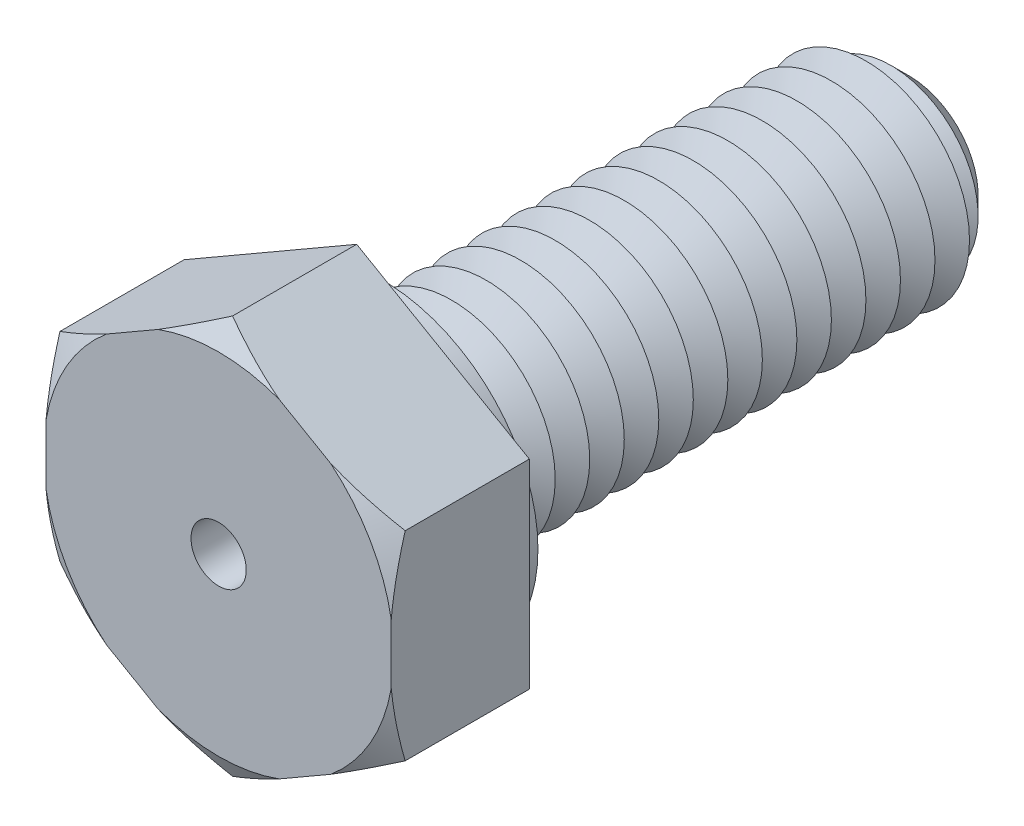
ISO-10303-21;
HEADER;
FILE_DESCRIPTION(('STEP AP214'),'2;1');
FILE_NAME('part.step','',(''),(''),'','','');
FILE_SCHEMA(('AUTOMOTIVE_DESIGN { 1 0 10303 214 1 1 1 1 }'));
ENDSEC;
DATA;
#1=APPLICATION_CONTEXT('core data for automotive mechanical design processes');
#2=APPLICATION_PROTOCOL_DEFINITION('international standard','automotive_design',2000,#1);
#3=PRODUCT_CONTEXT('',#1,'mechanical');
#4=PRODUCT('Part','Part','',(#3));
#5=PRODUCT_RELATED_PRODUCT_CATEGORY('part','',(#4));
#6=PRODUCT_DEFINITION_FORMATION('','',#4);
#7=PRODUCT_DEFINITION_CONTEXT('part definition',#1,'design');
#8=PRODUCT_DEFINITION('design','',#6,#7);
#9=PRODUCT_DEFINITION_SHAPE('','',#8);
#10=(LENGTH_UNIT() NAMED_UNIT(*) SI_UNIT(.MILLI.,.METRE.));
#11=(NAMED_UNIT(*) PLANE_ANGLE_UNIT() SI_UNIT($,.RADIAN.));
#12=(NAMED_UNIT(*) SI_UNIT($,.STERADIAN.) SOLID_ANGLE_UNIT());
#13=UNCERTAINTY_MEASURE_WITH_UNIT(LENGTH_MEASURE(1.E-05),#10,'distance_accuracy_value','');
#14=(GEOMETRIC_REPRESENTATION_CONTEXT(3) GLOBAL_UNCERTAINTY_ASSIGNED_CONTEXT((#13)) GLOBAL_UNIT_ASSIGNED_CONTEXT((#10,
#11,#12)) REPRESENTATION_CONTEXT('',''));
#15=CARTESIAN_POINT('',(0.,0.,0.));
#16=DIRECTION('',(0.,0.,1.));
#17=DIRECTION('',(1.,0.,0.));
#18=AXIS2_PLACEMENT_3D('',#15,#16,#17);
#19=CARTESIAN_POINT('',(5.,2.88675134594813,4.));
#20=DIRECTION('',(-0.5,-0.866025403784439,0.));
#21=DIRECTION('',(0.866025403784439,-0.5,0.));
#22=AXIS2_PLACEMENT_3D('',#19,#20,#21);
#23=PLANE('',#22);
#24=CARTESIAN_POINT('',(8.47277829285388,0.881741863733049,2.01100959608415));
#25=CARTESIAN_POINT('',(8.31567675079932,0.972444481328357,2.09578624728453));
#26=CARTESIAN_POINT('',(8.15819937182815,1.06336408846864,2.17964850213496));
#27=CARTESIAN_POINT('',(7.84233445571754,1.24572878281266,2.34511482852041));
#28=CARTESIAN_POINT('',(7.68394680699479,1.33717393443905,2.42671861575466));
#29=CARTESIAN_POINT('',(7.3656324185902,1.52095283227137,2.58747458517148));
#30=CARTESIAN_POINT('',(7.2057023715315,1.61328848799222,2.66661806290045));
#31=CARTESIAN_POINT('',(6.88464436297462,1.79865141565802,2.82158887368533));
#32=CARTESIAN_POINT('',(6.72351643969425,1.89167866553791,2.89741631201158));
#33=CARTESIAN_POINT('',(6.39574451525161,2.08091787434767,3.04691088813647));
#34=CARTESIAN_POINT('',(6.22906463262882,2.17715054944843,3.12047362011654));
#35=CARTESIAN_POINT('',(5.89404164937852,2.3705761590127,3.26235309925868));
#36=CARTESIAN_POINT('',(5.72569864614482,2.46776903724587,3.33067015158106));
#37=CARTESIAN_POINT('',(5.38728347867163,2.66315312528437,3.46077059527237));
#38=CARTESIAN_POINT('',(5.21721304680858,2.7613433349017,3.52255993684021));
#39=CARTESIAN_POINT('',(4.87507545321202,2.95887656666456,3.63817490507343));
#40=CARTESIAN_POINT('',(4.70300855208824,3.058219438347,3.69200155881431));
#41=CARTESIAN_POINT('',(4.29152467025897,3.29578976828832,3.8084273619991));
#42=CARTESIAN_POINT('',(4.05114917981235,3.43457062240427,3.86669526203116));
#43=CARTESIAN_POINT('',(3.68812002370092,3.64416560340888,3.93673911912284));
#44=CARTESIAN_POINT('',(3.56670137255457,3.71426669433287,3.95719387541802));
#45=CARTESIAN_POINT('',(3.32319777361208,3.85485356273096,3.99180309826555));
#46=CARTESIAN_POINT('',(3.20111291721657,3.92533928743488,4.0059584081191));
#47=CARTESIAN_POINT('',(2.95790980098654,4.06575267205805,4.0274398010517));
#48=CARTESIAN_POINT('',(2.83679666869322,4.13567737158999,4.03484289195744));
#49=CARTESIAN_POINT('',(2.59440145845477,4.27562431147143,4.04287861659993));
#50=CARTESIAN_POINT('',(2.47311938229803,4.34564655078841,4.0435113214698));
#51=CARTESIAN_POINT('',(2.23067249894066,4.48562332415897,4.03798617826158));
#52=CARTESIAN_POINT('',(2.10950769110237,4.55557785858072,4.03182836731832));
#53=CARTESIAN_POINT('',(1.86755304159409,4.695270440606,4.01290860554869));
#54=CARTESIAN_POINT('',(1.7467632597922,4.76500845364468,4.00014564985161));
#55=CARTESIAN_POINT('',(1.46148107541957,4.92971619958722,3.96252552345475));
#56=CARTESIAN_POINT('',(1.29725580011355,5.02453170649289,3.93494657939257));
#57=CARTESIAN_POINT('',(0.970375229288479,5.21325629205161,3.86938275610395));
#58=CARTESIAN_POINT('',(0.807720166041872,5.30716523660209,3.83139636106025));
#59=CARTESIAN_POINT('',(0.484000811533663,5.4940646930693,3.7464515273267));
#60=CARTESIAN_POINT('',(0.32293853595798,5.58705404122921,3.6994829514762));
#61=CARTESIAN_POINT('',(0.00262118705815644,5.77198934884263,3.59805355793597));
#62=CARTESIAN_POINT('',(-0.156634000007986,5.86393537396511,3.54359321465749));
#63=CARTESIAN_POINT('',(-0.475335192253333,6.04793759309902,3.42778810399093));
#64=CARTESIAN_POINT('',(-0.63476076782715,6.13998199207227,3.36636889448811));
#65=CARTESIAN_POINT('',(-0.951922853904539,6.3230956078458,3.2383676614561));
#66=CARTESIAN_POINT('',(-1.10966040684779,6.4141654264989,3.17178906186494));
#67=CARTESIAN_POINT('',(-1.42369760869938,6.59547488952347,3.03438397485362));
#68=CARTESIAN_POINT('',(-1.57999755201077,6.68571470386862,2.96355838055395));
#69=CARTESIAN_POINT('',(-1.89137153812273,6.86548655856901,2.81840247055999));
#70=CARTESIAN_POINT('',(-2.04644555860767,6.95501858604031,2.74407209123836));
#71=CARTESIAN_POINT('',(-2.30843737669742,7.1062796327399,2.61560341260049));
#72=CARTESIAN_POINT('',(-2.41563149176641,7.16816818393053,2.5622132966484));
#73=CARTESIAN_POINT('',(-2.62954890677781,7.29167346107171,2.45420118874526));
#74=CARTESIAN_POINT('',(-2.73627222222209,7.35329019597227,2.39957923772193));
#75=CARTESIAN_POINT('',(-2.94817046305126,7.4756297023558,2.28983212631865));
#76=CARTESIAN_POINT('',(-3.05334983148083,7.53635503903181,2.23471838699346));
#77=CARTESIAN_POINT('',(-3.26333506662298,7.65759007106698,2.12354428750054));
#78=CARTESIAN_POINT('',(-3.36814092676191,7.71809976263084,2.06748391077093));
#79=CARTESIAN_POINT('',(-3.47277829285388,7.77851217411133,2.01100959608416));
#80=B_SPLINE_CURVE_WITH_KNOTS('',3,(#24,#25,#26,#27,#28,#29,#30,#31,#32,#33,#34,#35,#36,#37,#38,
#39,#40,#41,#42,#43,#44,#45,#46,#47,#48,#49,#50,#51,#52,#53,#54,#55,#56,#57,#58,#59,#60,#61,#62,
#63,#64,#65,#66,#67,#68,#69,#70,#71,#72,#73,#74,#75,#76,#77,#78,#79),.UNSPECIFIED.,.F.,.F.,(4,2,
2,2,2,2,2,2,2,2,2,2,2,2,2,2,2,2,2,2,2,2,2,2,2,2,2,4),(0.,0.600718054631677,1.20151138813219,
1.80423204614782,2.40693355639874,3.02500509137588,3.64304064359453,4.26050788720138,
4.87789541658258,5.72780796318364,6.15275000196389,6.57763513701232,6.99761163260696,
7.41758371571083,7.83755350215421,8.25758719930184,8.83211758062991,9.40673168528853,
9.98199815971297,10.5572282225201,11.1393271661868,11.7210430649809,12.3026370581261,
12.8842416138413,13.2886376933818,13.6930203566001,14.0931288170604,14.493244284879),.UNSPECIFIED.);
#81=CARTESIAN_POINT('',(5.,2.88675134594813,3.59585481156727));
#82=VERTEX_POINT('',#81);
#83=CARTESIAN_POINT('',(3.24519941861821,3.89988593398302,4.));
#84=VERTEX_POINT('',#83);
#85=EDGE_CURVE('E132',#82,#84,#80,.T.);
#86=ORIENTED_EDGE('',*,*,#85,.F.);
#87=DIRECTION('',(0.,0.,-1.));
#88=VECTOR('',#87,1.);
#89=CARTESIAN_POINT('',(5.,2.88675134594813,4.));
#90=LINE('',#89,#88);
#91=CARTESIAN_POINT('',(5.,2.88675134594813,0.));
#92=VERTEX_POINT('',#91);
#93=EDGE_CURVE('E144',#82,#92,#90,.T.);
#94=ORIENTED_EDGE('',*,*,#93,.T.);
#95=DIRECTION('',(-0.866025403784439,0.5,0.));
#96=VECTOR('',#95,1.);
#97=CARTESIAN_POINT('',(5.,2.88675134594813,0.));
#98=LINE('',#97,#96);
#99=CARTESIAN_POINT('',(0.,5.77350269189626,0.));
#100=VERTEX_POINT('',#99);
#101=EDGE_CURVE('E322',#92,#100,#98,.T.);
#102=ORIENTED_EDGE('',*,*,#101,.T.);
#103=DIRECTION('',(0.,0.,-1.));
#104=VECTOR('',#103,1.);
#105=CARTESIAN_POINT('',(0.,5.77350269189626,4.));
#106=LINE('',#105,#104);
#107=CARTESIAN_POINT('',(0.,5.77350269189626,3.59585481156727));
#108=VERTEX_POINT('',#107);
#109=EDGE_CURVE('E177',#108,#100,#106,.T.);
#110=ORIENTED_EDGE('',*,*,#109,.F.);
#111=CARTESIAN_POINT('',(1.75480058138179,4.76036810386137,4.));
#112=VERTEX_POINT('',#111);
#113=EDGE_CURVE('E151',#112,#108,#80,.T.);
#114=ORIENTED_EDGE('',*,*,#113,.F.);
#115=DIRECTION('',(-0.866025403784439,0.5,0.));
#116=VECTOR('',#115,1.);
#117=CARTESIAN_POINT('',(5.,2.88675134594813,4.));
#118=LINE('',#117,#116);
#119=EDGE_CURVE('E148',#84,#112,#118,.T.);
#120=ORIENTED_EDGE('',*,*,#119,.F.);
#121=EDGE_LOOP('',(#86,#94,#102,#110,#114,#120));
#122=FACE_BOUND('',#121,.T.);
#123=ADVANCED_FACE('F39',(#122),#23,.F.);
#124=CARTESIAN_POINT('',(0.,5.77350269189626,4.));
#125=DIRECTION('',(0.5,-0.866025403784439,0.));
#126=DIRECTION('',(0.866025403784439,0.5,0.));
#127=AXIS2_PLACEMENT_3D('',#124,#125,#126);
#128=PLANE('',#127);
#129=CARTESIAN_POINT('',(3.47277829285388,7.77851217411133,2.01100959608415));
#130=CARTESIAN_POINT('',(3.31567675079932,7.68780955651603,2.09578624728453));
#131=CARTESIAN_POINT('',(3.15819937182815,7.59688994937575,2.17964850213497));
#132=CARTESIAN_POINT('',(2.84233445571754,7.41452525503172,2.34511482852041));
#133=CARTESIAN_POINT('',(2.68394680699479,7.32308010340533,2.42671861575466));
#134=CARTESIAN_POINT('',(2.36563241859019,7.13930120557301,2.58747458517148));
#135=CARTESIAN_POINT('',(2.2057023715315,7.04696554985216,2.66661806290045));
#136=CARTESIAN_POINT('',(1.88464436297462,6.86160262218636,2.82158887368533));
#137=CARTESIAN_POINT('',(1.72351643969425,6.76857537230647,2.89741631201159));
#138=CARTESIAN_POINT('',(1.39574451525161,6.57933616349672,3.04691088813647));
#139=CARTESIAN_POINT('',(1.22906463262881,6.48310348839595,3.12047362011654));
#140=CARTESIAN_POINT('',(0.894041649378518,6.28967787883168,3.26235309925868));
#141=CARTESIAN_POINT('',(0.725698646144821,6.19248500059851,3.33067015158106));
#142=CARTESIAN_POINT('',(0.38728347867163,5.99710091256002,3.46077059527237));
#143=CARTESIAN_POINT('',(0.217213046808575,5.89891070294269,3.52255993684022));
#144=CARTESIAN_POINT('',(-0.124924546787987,5.70137747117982,3.63817490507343));
#145=CARTESIAN_POINT('',(-0.296991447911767,5.60203459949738,3.69200155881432));
#146=CARTESIAN_POINT('',(-0.708475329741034,5.36446426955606,3.8084273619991));
#147=CARTESIAN_POINT('',(-0.948850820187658,5.22568341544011,3.86669526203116));
#148=CARTESIAN_POINT('',(-1.31187997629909,5.0160884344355,3.93673911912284));
#149=CARTESIAN_POINT('',(-1.43329862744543,4.94598734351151,3.95719387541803));
#150=CARTESIAN_POINT('',(-1.67680222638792,4.80540047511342,3.99180309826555));
#151=CARTESIAN_POINT('',(-1.79888708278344,4.7349147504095,4.0059584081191));
#152=CARTESIAN_POINT('',(-2.04209019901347,4.59450136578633,4.0274398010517));
#153=CARTESIAN_POINT('',(-2.16320333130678,4.52457666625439,4.03484289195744));
#154=CARTESIAN_POINT('',(-2.40559854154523,4.38462972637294,4.04287861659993));
#155=CARTESIAN_POINT('',(-2.52688061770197,4.31460748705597,4.04351132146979));
#156=CARTESIAN_POINT('',(-2.76932750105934,4.17463071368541,4.03798617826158));
#157=CARTESIAN_POINT('',(-2.89049230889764,4.10467617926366,4.03182836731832));
#158=CARTESIAN_POINT('',(-3.13244695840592,3.96498359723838,4.01290860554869));
#159=CARTESIAN_POINT('',(-3.25323674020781,3.8952455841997,4.00014564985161));
#160=CARTESIAN_POINT('',(-3.53851892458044,3.73053783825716,3.96252552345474));
#161=CARTESIAN_POINT('',(-3.70274419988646,3.63572233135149,3.93494657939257));
#162=CARTESIAN_POINT('',(-4.02962477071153,3.44699774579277,3.86938275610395));
#163=CARTESIAN_POINT('',(-4.19227983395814,3.35308880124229,3.83139636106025));
#164=CARTESIAN_POINT('',(-4.51599918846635,3.16618934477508,3.7464515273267));
#165=CARTESIAN_POINT('',(-4.67706146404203,3.07319999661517,3.6994829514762));
#166=CARTESIAN_POINT('',(-4.99737881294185,2.88826468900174,3.59805355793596));
#167=CARTESIAN_POINT('',(-5.156634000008,2.79631866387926,3.54359321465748));
#168=CARTESIAN_POINT('',(-5.47533519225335,2.61231644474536,3.42778810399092));
#169=CARTESIAN_POINT('',(-5.63476076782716,2.5202720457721,3.3663688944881));
#170=CARTESIAN_POINT('',(-5.95192285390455,2.33715842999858,3.23836766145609));
#171=CARTESIAN_POINT('',(-6.10966040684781,2.24608861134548,3.17178906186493));
#172=CARTESIAN_POINT('',(-6.4236976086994,2.0647791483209,3.03438397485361));
#173=CARTESIAN_POINT('',(-6.57999755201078,1.97453933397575,2.96355838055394));
#174=CARTESIAN_POINT('',(-6.89137153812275,1.79476747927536,2.81840247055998));
#175=CARTESIAN_POINT('',(-7.04644555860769,1.70523545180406,2.74407209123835));
#176=CARTESIAN_POINT('',(-7.30843737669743,1.55397440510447,2.61560341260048));
#177=CARTESIAN_POINT('',(-7.41563149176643,1.49208585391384,2.56221329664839));
#178=CARTESIAN_POINT('',(-7.62954890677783,1.36858057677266,2.45420118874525));
#179=CARTESIAN_POINT('',(-7.7362722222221,1.30696384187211,2.39957923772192));
#180=CARTESIAN_POINT('',(-7.94817046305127,1.18462433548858,2.28983212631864));
#181=CARTESIAN_POINT('',(-8.05334983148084,1.12389899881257,2.23471838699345));
#182=CARTESIAN_POINT('',(-8.26333506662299,1.0026639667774,2.12354428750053));
#183=CARTESIAN_POINT('',(-8.36814092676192,0.94215427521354,2.06748391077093));
#184=CARTESIAN_POINT('',(-8.47277829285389,0.881741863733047,2.01100959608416));
#185=B_SPLINE_CURVE_WITH_KNOTS('',3,(#129,#130,#131,#132,#133,#134,#135,#136,#137,#138,#139,
#140,#141,#142,#143,#144,#145,#146,#147,#148,#149,#150,#151,#152,#153,#154,#155,#156,#157,#158,
#159,#160,#161,#162,#163,#164,#165,#166,#167,#168,#169,#170,#171,#172,#173,#174,#175,#176,#177,
#178,#179,#180,#181,#182,#183,#184),.UNSPECIFIED.,.F.,.F.,(4,2,2,2,2,2,2,2,2,2,2,2,2,2,2,2,2,2,
2,2,2,2,2,2,2,2,2,4),(0.,0.600718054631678,1.20151138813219,1.80423204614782,2.40693355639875,
3.02500509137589,3.64304064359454,4.26050788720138,4.87789541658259,5.72780796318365,
6.1527500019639,6.57763513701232,6.99761163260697,7.41758371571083,7.83755350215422,
8.25758719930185,8.83211758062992,9.40673168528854,9.98199815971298,10.5572282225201,
11.1393271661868,11.7210430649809,12.3026370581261,12.8842416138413,13.2886376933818,
13.6930203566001,14.0931288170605,14.493244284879),.UNSPECIFIED.);
#186=CARTESIAN_POINT('',(-1.75480058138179,4.76036810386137,4.));
#187=VERTEX_POINT('',#186);
#188=EDGE_CURVE('E361',#108,#187,#185,.T.);
#189=ORIENTED_EDGE('',*,*,#188,.F.);
#190=ORIENTED_EDGE('',*,*,#109,.T.);
#191=DIRECTION('',(-0.866025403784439,-0.5,0.));
#192=VECTOR('',#191,1.);
#193=CARTESIAN_POINT('',(0.,5.77350269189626,0.));
#194=LINE('',#193,#192);
#195=CARTESIAN_POINT('',(-5.,2.88675134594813,0.));
#196=VERTEX_POINT('',#195);
#197=EDGE_CURVE('E341',#100,#196,#194,.T.);
#198=ORIENTED_EDGE('',*,*,#197,.T.);
#199=DIRECTION('',(0.,0.,-1.));
#200=VECTOR('',#199,1.);
#201=CARTESIAN_POINT('',(-5.,2.88675134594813,4.));
#202=LINE('',#201,#200);
#203=CARTESIAN_POINT('',(-5.,2.88675134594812,3.59585481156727));
#204=VERTEX_POINT('',#203);
#205=EDGE_CURVE('E174',#204,#196,#202,.T.);
#206=ORIENTED_EDGE('',*,*,#205,.F.);
#207=CARTESIAN_POINT('',(-3.24519941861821,3.89988593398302,4.));
#208=VERTEX_POINT('',#207);
#209=EDGE_CURVE('E360',#208,#204,#185,.T.);
#210=ORIENTED_EDGE('',*,*,#209,.F.);
#211=DIRECTION('',(-0.866025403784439,-0.5,0.));
#212=VECTOR('',#211,1.);
#213=CARTESIAN_POINT('',(0.,5.77350269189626,4.));
#214=LINE('',#213,#212);
#215=EDGE_CURVE('E324',#187,#208,#214,.T.);
#216=ORIENTED_EDGE('',*,*,#215,.F.);
#217=EDGE_LOOP('',(#189,#190,#198,#206,#210,#216));
#218=FACE_BOUND('',#217,.T.);
#219=ADVANCED_FACE('F380',(#218),#128,.F.);
#220=CARTESIAN_POINT('',(-5.,2.88675134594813,4.));
#221=DIRECTION('',(1.,0.,0.));
#222=DIRECTION('',(0.,0.,-1.));
#223=AXIS2_PLACEMENT_3D('',#220,#221,#222);
#224=PLANE('',#223);
#225=CARTESIAN_POINT('',(-5.,6.35952963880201,2.25858442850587));
#226=CARTESIAN_POINT('',(-5.,6.17888675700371,2.34055079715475));
#227=CARTESIAN_POINT('',(-5.,5.99774985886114,2.42144915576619));
#228=CARTESIAN_POINT('',(-5.,5.63427640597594,2.58059164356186));
#229=CARTESIAN_POINT('',(-5.,5.45193964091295,2.65883529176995));
#230=CARTESIAN_POINT('',(-5.,5.08515575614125,2.81244019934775));
#231=CARTESIAN_POINT('',(-5.,4.90070300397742,2.8877880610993));
#232=CARTESIAN_POINT('',(-5.,4.53023851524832,3.0345384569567));
#233=CARTESIAN_POINT('',(-5.,4.34422685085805,3.10594117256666));
#234=CARTESIAN_POINT('',(-5.,3.9712497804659,3.24361472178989));
#235=CARTESIAN_POINT('',(-5.,3.78429235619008,3.30990707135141));
#236=CARTESIAN_POINT('',(-5.,3.40837814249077,3.43663614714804));
#237=CARTESIAN_POINT('',(-5.,3.21942124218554,3.49707254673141));
#238=CARTESIAN_POINT('',(-5.,2.83960832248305,3.61070280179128));
#239=CARTESIAN_POINT('',(-5.,2.64875526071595,3.66390646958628));
#240=CARTESIAN_POINT('',(-5.,2.26482213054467,3.76165698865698));
#241=CARTESIAN_POINT('',(-5.,2.07174215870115,3.80620421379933));
#242=CARTESIAN_POINT('',(-5.,1.7384332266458,3.87385543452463));
#243=CARTESIAN_POINT('',(-5.,1.59871159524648,3.89946008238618));
#244=CARTESIAN_POINT('',(-5.,1.31833206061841,3.94478995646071));
#245=CARTESIAN_POINT('',(-5.,1.17767431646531,3.96451615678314));
#246=CARTESIAN_POINT('',(-5.,0.895629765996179,3.99757345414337));
#247=CARTESIAN_POINT('',(-5.,0.754243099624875,4.01090573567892));
#248=CARTESIAN_POINT('',(-5.,0.470989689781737,4.03079351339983));
#249=CARTESIAN_POINT('',(-5.,0.329122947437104,4.03734902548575));
#250=CARTESIAN_POINT('',(-5.,0.0453101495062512,4.04347876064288));
#251=CARTESIAN_POINT('',(-5.,-0.0966358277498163,4.04305657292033));
#252=CARTESIAN_POINT('',(-5.,-0.380333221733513,4.03525341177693));
#253=CARTESIAN_POINT('',(-5.,-0.522084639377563,4.02787247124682));
#254=CARTESIAN_POINT('',(-5.,-0.805078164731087,4.00637695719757));
#255=CARTESIAN_POINT('',(-5.,-0.946320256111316,3.99226216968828));
#256=CARTESIAN_POINT('',(-5.,-1.22803871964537,3.95770663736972));
#257=CARTESIAN_POINT('',(-5.,-1.36851494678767,3.93726473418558));
#258=CARTESIAN_POINT('',(-5.,-1.92842653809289,3.84388033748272));
#259=CARTESIAN_POINT('',(-5.,-2.34409397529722,3.74768165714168));
#260=CARTESIAN_POINT('',(-5.,-2.95991397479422,3.57615402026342));
#261=CARTESIAN_POINT('',(-5.,-3.16417440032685,3.51433916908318));
#262=CARTESIAN_POINT('',(-5.,-3.57033913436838,3.3833457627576));
#263=CARTESIAN_POINT('',(-5.,-3.77224360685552,3.31416772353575));
#264=CARTESIAN_POINT('',(-5.,-4.17620397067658,3.16907432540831));
#265=CARTESIAN_POINT('',(-5.,-4.37823505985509,3.09309081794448));
#266=CARTESIAN_POINT('',(-5.,-4.78041106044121,2.93626257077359));
#267=CARTESIAN_POINT('',(-5.,-4.98055585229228,2.85541752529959));
#268=CARTESIAN_POINT('',(-5.,-5.37797431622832,2.69033488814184));
#269=CARTESIAN_POINT('',(-5.,-5.57525810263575,2.60612151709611));
#270=CARTESIAN_POINT('',(-5.,-5.96839598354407,2.43454627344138));
#271=CARTESIAN_POINT('',(-5.,-6.16425041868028,2.34718518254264));
#272=CARTESIAN_POINT('',(-5.,-6.35952963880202,2.25858442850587));
#273=B_SPLINE_CURVE_WITH_KNOTS('',3,(#225,#226,#227,#228,#229,#230,#231,#232,#233,#234,#235,
#236,#237,#238,#239,#240,#241,#242,#243,#244,#245,#246,#247,#248,#249,#250,#251,#252,#253,#254,
#255,#256,#257,#258,#259,#260,#261,#262,#263,#264,#265,#266,#267,#268,#269,#270,#271,#272),
.UNSPECIFIED.,.F.,.F.,(4,2,2,2,2,2,2,2,2,2,2,2,2,2,2,2,2,2,2,2,2,2,2,4),(0.,0.595116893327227,
1.19034103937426,1.78805021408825,2.3857318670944,2.98074146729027,3.57578423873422,
4.17001151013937,4.7642131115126,5.19024951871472,5.61621528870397,6.0421021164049,
6.46798794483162,6.89365471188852,7.3193194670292,7.74499774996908,8.17075401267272,
9.44769357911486,10.0878733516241,10.7280082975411,11.3754821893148,12.0229968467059,
12.6664852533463,13.3098149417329),.UNSPECIFIED.);
#274=CARTESIAN_POINT('',(-5.,0.86048216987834,4.));
#275=VERTEX_POINT('',#274);
#276=EDGE_CURVE('E362',#204,#275,#273,.T.);
#277=ORIENTED_EDGE('',*,*,#276,.F.);
#278=ORIENTED_EDGE('',*,*,#205,.T.);
#279=DIRECTION('',(0.,-1.,0.));
#280=VECTOR('',#279,1.);
#281=CARTESIAN_POINT('',(-5.,2.88675134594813,0.));
#282=LINE('',#281,#280);
#283=CARTESIAN_POINT('',(-5.,-2.88675134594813,0.));
#284=VERTEX_POINT('',#283);
#285=EDGE_CURVE('E345',#196,#284,#282,.T.);
#286=ORIENTED_EDGE('',*,*,#285,.T.);
#287=DIRECTION('',(0.,0.,-1.));
#288=VECTOR('',#287,1.);
#289=CARTESIAN_POINT('',(-5.,-2.88675134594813,4.));
#290=LINE('',#289,#288);
#291=CARTESIAN_POINT('',(-4.99999999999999,-2.88675134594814,3.59585481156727));
#292=VERTEX_POINT('',#291);
#293=EDGE_CURVE('E171',#292,#284,#290,.T.);
#294=ORIENTED_EDGE('',*,*,#293,.F.);
#295=CARTESIAN_POINT('',(-5.,-0.86048216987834,4.));
#296=VERTEX_POINT('',#295);
#297=EDGE_CURVE('E368',#296,#292,#273,.T.);
#298=ORIENTED_EDGE('',*,*,#297,.F.);
#299=DIRECTION('',(0.,-1.,0.));
#300=VECTOR('',#299,1.);
#301=CARTESIAN_POINT('',(-5.,2.88675134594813,4.));
#302=LINE('',#301,#300);
#303=EDGE_CURVE('E328',#275,#296,#302,.T.);
#304=ORIENTED_EDGE('',*,*,#303,.F.);
#305=EDGE_LOOP('',(#277,#278,#286,#294,#298,#304));
#306=FACE_BOUND('',#305,.T.);
#307=ADVANCED_FACE('F422',(#306),#224,.F.);
#308=CARTESIAN_POINT('',(-5.,-2.88675134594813,4.));
#309=DIRECTION('',(0.5,0.866025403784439,0.));
#310=DIRECTION('',(-0.866025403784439,0.5,0.));
#311=AXIS2_PLACEMENT_3D('',#308,#309,#310);
#312=PLANE('',#311);
#313=CARTESIAN_POINT('',(-8.47277829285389,-0.881741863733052,2.01100959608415));
#314=CARTESIAN_POINT('',(-8.31567675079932,-0.972444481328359,2.09578624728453));
#315=CARTESIAN_POINT('',(-8.15819937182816,-1.06336408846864,2.17964850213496));
#316=CARTESIAN_POINT('',(-7.84233445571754,-1.24572878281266,2.34511482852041));
#317=CARTESIAN_POINT('',(-7.68394680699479,-1.33717393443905,2.42671861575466));
#318=CARTESIAN_POINT('',(-7.3656324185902,-1.52095283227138,2.58747458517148));
#319=CARTESIAN_POINT('',(-7.2057023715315,-1.61328848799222,2.66661806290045));
#320=CARTESIAN_POINT('',(-6.88464436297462,-1.79865141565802,2.82158887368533));
#321=CARTESIAN_POINT('',(-6.72351643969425,-1.89167866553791,2.89741631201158));
#322=CARTESIAN_POINT('',(-6.39574451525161,-2.08091787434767,3.04691088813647));
#323=CARTESIAN_POINT('',(-6.22906463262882,-2.17715054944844,3.12047362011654));
#324=CARTESIAN_POINT('',(-5.89404164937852,-2.37057615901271,3.26235309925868));
#325=CARTESIAN_POINT('',(-5.72569864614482,-2.46776903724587,3.33067015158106));
#326=CARTESIAN_POINT('',(-5.38728347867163,-2.66315312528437,3.46077059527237));
#327=CARTESIAN_POINT('',(-5.21721304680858,-2.7613433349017,3.52255993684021));
#328=CARTESIAN_POINT('',(-4.87507545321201,-2.95887656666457,3.63817490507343));
#329=CARTESIAN_POINT('',(-4.70300855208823,-3.05821943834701,3.69200155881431));
#330=CARTESIAN_POINT('',(-4.29152467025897,-3.29578976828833,3.8084273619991));
#331=CARTESIAN_POINT('',(-4.05114917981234,-3.43457062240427,3.86669526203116));
#332=CARTESIAN_POINT('',(-3.68812002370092,-3.64416560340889,3.93673911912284));
#333=CARTESIAN_POINT('',(-3.56670137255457,-3.71426669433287,3.95719387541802));
#334=CARTESIAN_POINT('',(-3.32319777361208,-3.85485356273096,3.99180309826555));
#335=CARTESIAN_POINT('',(-3.20111291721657,-3.92533928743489,4.0059584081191));
#336=CARTESIAN_POINT('',(-2.95790980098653,-4.06575267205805,4.0274398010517));
#337=CARTESIAN_POINT('',(-2.83679666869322,-4.13567737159,4.03484289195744));
#338=CARTESIAN_POINT('',(-2.59440145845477,-4.27562431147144,4.04287861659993));
#339=CARTESIAN_POINT('',(-2.47311938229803,-4.34564655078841,4.04351132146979));
#340=CARTESIAN_POINT('',(-2.23067249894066,-4.48562332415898,4.03798617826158));
#341=CARTESIAN_POINT('',(-2.10950769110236,-4.55557785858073,4.03182836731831));
#342=CARTESIAN_POINT('',(-1.86755304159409,-4.69527044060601,4.01290860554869));
#343=CARTESIAN_POINT('',(-1.74676325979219,-4.76500845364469,4.00014564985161));
#344=CARTESIAN_POINT('',(-1.46148107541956,-4.92971619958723,3.96252552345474));
#345=CARTESIAN_POINT('',(-1.29725580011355,-5.0245317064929,3.93494657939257));
#346=CARTESIAN_POINT('',(-0.970375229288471,-5.21325629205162,3.86938275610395));
#347=CARTESIAN_POINT('',(-0.807720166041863,-5.3071652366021,3.83139636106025));
#348=CARTESIAN_POINT('',(-0.484000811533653,-5.49406469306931,3.7464515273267));
#349=CARTESIAN_POINT('',(-0.322938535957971,-5.58705404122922,3.6994829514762));
#350=CARTESIAN_POINT('',(-0.00262118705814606,-5.77198934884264,3.59805355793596));
#351=CARTESIAN_POINT('',(0.156634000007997,-5.86393537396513,3.54359321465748));
#352=CARTESIAN_POINT('',(0.475335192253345,-6.04793759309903,3.42778810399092));
#353=CARTESIAN_POINT('',(0.634760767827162,-6.13998199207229,3.3663688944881));
#354=CARTESIAN_POINT('',(0.951922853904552,-6.32309560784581,3.23836766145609));
#355=CARTESIAN_POINT('',(1.10966040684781,-6.41416542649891,3.17178906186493));
#356=CARTESIAN_POINT('',(1.4236976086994,-6.59547488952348,3.03438397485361));
#357=CARTESIAN_POINT('',(1.57999755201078,-6.68571470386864,2.96355838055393));
#358=CARTESIAN_POINT('',(1.89137153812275,-6.86548655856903,2.81840247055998));
#359=CARTESIAN_POINT('',(2.04644555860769,-6.95501858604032,2.74407209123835));
#360=CARTESIAN_POINT('',(2.30843737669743,-7.10627963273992,2.61560341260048));
#361=CARTESIAN_POINT('',(2.41563149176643,-7.16816818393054,2.56221329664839));
#362=CARTESIAN_POINT('',(2.62954890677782,-7.29167346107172,2.45420118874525));
#363=CARTESIAN_POINT('',(2.73627222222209,-7.35329019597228,2.39957923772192));
#364=CARTESIAN_POINT('',(2.94817046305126,-7.47562970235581,2.28983212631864));
#365=CARTESIAN_POINT('',(3.05334983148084,-7.53635503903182,2.23471838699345));
#366=CARTESIAN_POINT('',(3.26333506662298,-7.65759007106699,2.12354428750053));
#367=CARTESIAN_POINT('',(3.36814092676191,-7.71809976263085,2.06748391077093));
#368=CARTESIAN_POINT('',(3.47277829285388,-7.77851217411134,2.01100959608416));
#369=B_SPLINE_CURVE_WITH_KNOTS('',3,(#313,#314,#315,#316,#317,#318,#319,#320,#321,#322,#323,
#324,#325,#326,#327,#328,#329,#330,#331,#332,#333,#334,#335,#336,#337,#338,#339,#340,#341,#342,
#343,#344,#345,#346,#347,#348,#349,#350,#351,#352,#353,#354,#355,#356,#357,#358,#359,#360,#361,
#362,#363,#364,#365,#366,#367,#368),.UNSPECIFIED.,.F.,.F.,(4,2,2,2,2,2,2,2,2,2,2,2,2,2,2,2,2,2,
2,2,2,2,2,2,2,2,2,4),(0.,0.600718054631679,1.20151138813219,1.80423204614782,2.40693355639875,
3.02500509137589,3.64304064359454,4.26050788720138,4.87789541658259,5.72780796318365,
6.1527500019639,6.57763513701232,6.99761163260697,7.41758371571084,7.83755350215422,
8.25758719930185,8.83211758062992,9.40673168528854,9.98199815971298,10.5572282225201,
11.1393271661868,11.7210430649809,12.3026370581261,12.8842416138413,13.2886376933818,
13.6930203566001,14.0931288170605,14.493244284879),.UNSPECIFIED.);
#370=CARTESIAN_POINT('',(-3.24519941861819,-3.89988593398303,4.));
#371=VERTEX_POINT('',#370);
#372=EDGE_CURVE('E417',#292,#371,#369,.T.);
#373=ORIENTED_EDGE('',*,*,#372,.F.);
#374=ORIENTED_EDGE('',*,*,#293,.T.);
#375=DIRECTION('',(0.866025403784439,-0.5,0.));
#376=VECTOR('',#375,1.);
#377=CARTESIAN_POINT('',(-5.,-2.88675134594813,0.));
#378=LINE('',#377,#376);
#379=CARTESIAN_POINT('',(0.,-5.77350269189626,0.));
#380=VERTEX_POINT('',#379);
#381=EDGE_CURVE('E348',#284,#380,#378,.T.);
#382=ORIENTED_EDGE('',*,*,#381,.T.);
#383=DIRECTION('',(0.,0.,-1.));
#384=VECTOR('',#383,1.);
#385=CARTESIAN_POINT('',(0.,-5.77350269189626,4.));
#386=LINE('',#385,#384);
#387=CARTESIAN_POINT('',(0.,-5.77350269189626,3.59585481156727));
#388=VERTEX_POINT('',#387);
#389=EDGE_CURVE('E161',#388,#380,#386,.T.);
#390=ORIENTED_EDGE('',*,*,#389,.F.);
#391=CARTESIAN_POINT('',(-1.75480058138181,-4.76036810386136,4.));
#392=VERTEX_POINT('',#391);
#393=EDGE_CURVE('E411',#392,#388,#369,.T.);
#394=ORIENTED_EDGE('',*,*,#393,.F.);
#395=DIRECTION('',(0.866025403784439,-0.5,0.));
#396=VECTOR('',#395,1.);
#397=CARTESIAN_POINT('',(-5.,-2.88675134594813,4.));
#398=LINE('',#397,#396);
#399=EDGE_CURVE('E332',#371,#392,#398,.T.);
#400=ORIENTED_EDGE('',*,*,#399,.F.);
#401=EDGE_LOOP('',(#373,#374,#382,#390,#394,#400));
#402=FACE_BOUND('',#401,.T.);
#403=ADVANCED_FACE('F418',(#402),#312,.F.);
#404=CARTESIAN_POINT('',(0.,-5.77350269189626,4.));
#405=DIRECTION('',(-0.5,0.866025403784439,0.));
#406=DIRECTION('',(-0.866025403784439,-0.5,0.));
#407=AXIS2_PLACEMENT_3D('',#404,#405,#406);
#408=PLANE('',#407);
#409=CARTESIAN_POINT('',(-3.47277829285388,-7.77851217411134,2.01100959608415));
#410=CARTESIAN_POINT('',(-3.31567675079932,-7.68780955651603,2.09578624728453));
#411=CARTESIAN_POINT('',(-3.15819937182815,-7.59688994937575,2.17964850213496));
#412=CARTESIAN_POINT('',(-2.84233445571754,-7.41452525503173,2.34511482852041));
#413=CARTESIAN_POINT('',(-2.68394680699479,-7.32308010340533,2.42671861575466));
#414=CARTESIAN_POINT('',(-2.36563241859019,-7.13930120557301,2.58747458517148));
#415=CARTESIAN_POINT('',(-2.2057023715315,-7.04696554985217,2.66661806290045));
#416=CARTESIAN_POINT('',(-1.88464436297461,-6.86160262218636,2.82158887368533));
#417=CARTESIAN_POINT('',(-1.72351643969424,-6.76857537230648,2.89741631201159));
#418=CARTESIAN_POINT('',(-1.39574451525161,-6.57933616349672,3.04691088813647));
#419=CARTESIAN_POINT('',(-1.22906463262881,-6.48310348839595,3.12047362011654));
#420=CARTESIAN_POINT('',(-0.894041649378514,-6.28967787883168,3.26235309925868));
#421=CARTESIAN_POINT('',(-0.725698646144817,-6.19248500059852,3.33067015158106));
#422=CARTESIAN_POINT('',(-0.387283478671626,-5.99710091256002,3.46077059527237));
#423=CARTESIAN_POINT('',(-0.217213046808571,-5.89891070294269,3.52255993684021));
#424=CARTESIAN_POINT('',(0.124924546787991,-5.70137747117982,3.63817490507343));
#425=CARTESIAN_POINT('',(0.296991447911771,-5.60203459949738,3.69200155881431));
#426=CARTESIAN_POINT('',(0.708475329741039,-5.36446426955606,3.8084273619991));
#427=CARTESIAN_POINT('',(0.948850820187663,-5.22568341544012,3.86669526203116));
#428=CARTESIAN_POINT('',(1.31187997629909,-5.0160884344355,3.93673911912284));
#429=CARTESIAN_POINT('',(1.43329862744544,-4.94598734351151,3.95719387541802));
#430=CARTESIAN_POINT('',(1.67680222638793,-4.80540047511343,3.99180309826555));
#431=CARTESIAN_POINT('',(1.79888708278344,-4.7349147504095,4.0059584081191));
#432=CARTESIAN_POINT('',(2.04209019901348,-4.59450136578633,4.0274398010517));
#433=CARTESIAN_POINT('',(2.16320333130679,-4.52457666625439,4.03484289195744));
#434=CARTESIAN_POINT('',(2.40559854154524,-4.38462972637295,4.04287861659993));
#435=CARTESIAN_POINT('',(2.52688061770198,-4.31460748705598,4.04351132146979));
#436=CARTESIAN_POINT('',(2.76932750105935,-4.17463071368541,4.03798617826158));
#437=CARTESIAN_POINT('',(2.89049230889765,-4.10467617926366,4.03182836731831));
#438=CARTESIAN_POINT('',(3.13244695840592,-3.96498359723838,4.01290860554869));
#439=CARTESIAN_POINT('',(3.25323674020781,-3.8952455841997,4.00014564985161));
#440=CARTESIAN_POINT('',(3.53851892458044,-3.73053783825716,3.96252552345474));
#441=CARTESIAN_POINT('',(3.70274419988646,-3.63572233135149,3.93494657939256));
#442=CARTESIAN_POINT('',(4.02962477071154,-3.44699774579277,3.86938275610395));
#443=CARTESIAN_POINT('',(4.19227983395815,-3.35308880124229,3.83139636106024));
#444=CARTESIAN_POINT('',(4.51599918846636,-3.16618934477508,3.7464515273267));
#445=CARTESIAN_POINT('',(4.67706146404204,-3.07319999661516,3.69948295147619));
#446=CARTESIAN_POINT('',(4.99737881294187,-2.88826468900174,3.59805355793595));
#447=CARTESIAN_POINT('',(5.15663400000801,-2.79631866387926,3.54359321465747));
#448=CARTESIAN_POINT('',(5.47533519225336,-2.61231644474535,3.42778810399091));
#449=CARTESIAN_POINT('',(5.63476076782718,-2.5202720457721,3.3663688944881));
#450=CARTESIAN_POINT('',(5.95192285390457,-2.33715842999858,3.23836766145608));
#451=CARTESIAN_POINT('',(6.10966040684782,-2.24608861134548,3.17178906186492));
#452=CARTESIAN_POINT('',(6.42369760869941,-2.0647791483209,3.0343839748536));
#453=CARTESIAN_POINT('',(6.5799975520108,-1.97453933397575,2.96355838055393));
#454=CARTESIAN_POINT('',(6.89137153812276,-1.79476747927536,2.81840247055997));
#455=CARTESIAN_POINT('',(7.04644555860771,-1.70523545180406,2.74407209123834));
#456=CARTESIAN_POINT('',(7.30843737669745,-1.55397440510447,2.61560341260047));
#457=CARTESIAN_POINT('',(7.41563149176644,-1.49208585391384,2.56221329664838));
#458=CARTESIAN_POINT('',(7.62954890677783,-1.36858057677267,2.45420118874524));
#459=CARTESIAN_POINT('',(7.7362722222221,-1.30696384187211,2.39957923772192));
#460=CARTESIAN_POINT('',(7.94817046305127,-1.18462433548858,2.28983212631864));
#461=CARTESIAN_POINT('',(8.05334983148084,-1.12389899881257,2.23471838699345));
#462=CARTESIAN_POINT('',(8.26333506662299,-1.00266396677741,2.12354428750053));
#463=CARTESIAN_POINT('',(8.36814092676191,-0.942154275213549,2.06748391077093));
#464=CARTESIAN_POINT('',(8.47277829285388,-0.881741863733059,2.01100959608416));
#465=B_SPLINE_CURVE_WITH_KNOTS('',3,(#409,#410,#411,#412,#413,#414,#415,#416,#417,#418,#419,
#420,#421,#422,#423,#424,#425,#426,#427,#428,#429,#430,#431,#432,#433,#434,#435,#436,#437,#438,
#439,#440,#441,#442,#443,#444,#445,#446,#447,#448,#449,#450,#451,#452,#453,#454,#455,#456,#457,
#458,#459,#460,#461,#462,#463,#464),.UNSPECIFIED.,.F.,.F.,(4,2,2,2,2,2,2,2,2,2,2,2,2,2,2,2,2,2,
2,2,2,2,2,2,2,2,2,4),(0.,0.600718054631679,1.20151138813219,1.80423204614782,2.40693355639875,
3.02500509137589,3.64304064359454,4.26050788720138,4.87789541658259,5.72780796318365,
6.1527500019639,6.57763513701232,6.99761163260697,7.41758371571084,7.83755350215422,
8.25758719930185,8.83211758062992,9.40673168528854,9.98199815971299,10.5572282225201,
11.1393271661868,11.7210430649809,12.3026370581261,12.8842416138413,13.2886376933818,
13.6930203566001,14.0931288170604,14.493244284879),.UNSPECIFIED.);
#466=CARTESIAN_POINT('',(1.75480058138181,-4.76036810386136,4.));
#467=VERTEX_POINT('',#466);
#468=EDGE_CURVE('E64',#388,#467,#465,.T.);
#469=ORIENTED_EDGE('',*,*,#468,.F.);
#470=ORIENTED_EDGE('',*,*,#389,.T.);
#471=DIRECTION('',(0.866025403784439,0.5,0.));
#472=VECTOR('',#471,1.);
#473=CARTESIAN_POINT('',(0.,-5.77350269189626,0.));
#474=LINE('',#473,#472);
#475=CARTESIAN_POINT('',(5.,-2.88675134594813,0.));
#476=VERTEX_POINT('',#475);
#477=EDGE_CURVE('E351',#380,#476,#474,.T.);
#478=ORIENTED_EDGE('',*,*,#477,.T.);
#479=DIRECTION('',(0.,0.,-1.));
#480=VECTOR('',#479,1.);
#481=CARTESIAN_POINT('',(5.,-2.88675134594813,4.));
#482=LINE('',#481,#480);
#483=CARTESIAN_POINT('',(5.,-2.88675134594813,3.59585481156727));
#484=VERTEX_POINT('',#483);
#485=EDGE_CURVE('E157',#484,#476,#482,.T.);
#486=ORIENTED_EDGE('',*,*,#485,.F.);
#487=CARTESIAN_POINT('',(3.24519941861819,-3.89988593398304,4.));
#488=VERTEX_POINT('',#487);
#489=EDGE_CURVE('E406',#488,#484,#465,.T.);
#490=ORIENTED_EDGE('',*,*,#489,.F.);
#491=DIRECTION('',(0.866025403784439,0.5,0.));
#492=VECTOR('',#491,1.);
#493=CARTESIAN_POINT('',(0.,-5.77350269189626,4.));
#494=LINE('',#493,#492);
#495=EDGE_CURVE('E164',#467,#488,#494,.T.);
#496=ORIENTED_EDGE('',*,*,#495,.F.);
#497=EDGE_LOOP('',(#469,#470,#478,#486,#490,#496));
#498=FACE_BOUND('',#497,.T.);
#499=ADVANCED_FACE('F421',(#498),#408,.F.);
#500=CARTESIAN_POINT('',(5.,-2.88675134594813,4.));
#501=DIRECTION('',(-1.,0.,0.));
#502=DIRECTION('',(0.,-1.,0.));
#503=AXIS2_PLACEMENT_3D('',#500,#501,#502);
#504=PLANE('',#503);
#505=CARTESIAN_POINT('',(5.,-6.35952963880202,2.25858442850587));
#506=CARTESIAN_POINT('',(5.,-6.17888675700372,2.34055079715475));
#507=CARTESIAN_POINT('',(5.,-5.99774985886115,2.42144915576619));
#508=CARTESIAN_POINT('',(5.,-5.63427640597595,2.58059164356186));
#509=CARTESIAN_POINT('',(5.,-5.45193964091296,2.65883529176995));
#510=CARTESIAN_POINT('',(5.,-5.08515575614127,2.81244019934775));
#511=CARTESIAN_POINT('',(5.,-4.90070300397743,2.8877880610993));
#512=CARTESIAN_POINT('',(5.,-4.53023851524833,3.0345384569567));
#513=CARTESIAN_POINT('',(5.,-4.34422685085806,3.10594117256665));
#514=CARTESIAN_POINT('',(5.,-3.97124978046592,3.24361472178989));
#515=CARTESIAN_POINT('',(5.,-3.78429235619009,3.3099070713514));
#516=CARTESIAN_POINT('',(5.,-3.40837814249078,3.43663614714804));
#517=CARTESIAN_POINT('',(5.,-3.21942124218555,3.4970725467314));
#518=CARTESIAN_POINT('',(5.,-2.83960832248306,3.61070280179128));
#519=CARTESIAN_POINT('',(5.,-2.64875526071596,3.66390646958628));
#520=CARTESIAN_POINT('',(5.,-2.26482213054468,3.76165698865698));
#521=CARTESIAN_POINT('',(5.,-2.07174215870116,3.80620421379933));
#522=CARTESIAN_POINT('',(5.,-1.7384332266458,3.87385543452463));
#523=CARTESIAN_POINT('',(5.,-1.59871159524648,3.89946008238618));
#524=CARTESIAN_POINT('',(5.,-1.31833206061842,3.94478995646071));
#525=CARTESIAN_POINT('',(5.,-1.17767431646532,3.96451615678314));
#526=CARTESIAN_POINT('',(5.,-0.895629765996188,3.99757345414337));
#527=CARTESIAN_POINT('',(5.,-0.754243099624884,4.01090573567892));
#528=CARTESIAN_POINT('',(5.,-0.470989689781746,4.03079351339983));
#529=CARTESIAN_POINT('',(5.,-0.329122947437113,4.03734902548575));
#530=CARTESIAN_POINT('',(5.,-0.0453101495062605,4.04347876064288));
#531=CARTESIAN_POINT('',(5.,0.0966358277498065,4.04305657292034));
#532=CARTESIAN_POINT('',(5.,0.380333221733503,4.03525341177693));
#533=CARTESIAN_POINT('',(5.,0.522084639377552,4.02787247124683));
#534=CARTESIAN_POINT('',(5.,0.805078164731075,4.00637695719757));
#535=CARTESIAN_POINT('',(5.,0.946320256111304,3.99226216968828));
#536=CARTESIAN_POINT('',(5.,1.22803871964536,3.95770663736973));
#537=CARTESIAN_POINT('',(5.,1.36851494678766,3.93726473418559));
#538=CARTESIAN_POINT('',(5.,1.92842653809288,3.84388033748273));
#539=CARTESIAN_POINT('',(5.,2.34409397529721,3.74768165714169));
#540=CARTESIAN_POINT('',(5.,2.95991397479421,3.57615402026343));
#541=CARTESIAN_POINT('',(5.,3.16417440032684,3.51433916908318));
#542=CARTESIAN_POINT('',(5.,3.57033913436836,3.3833457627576));
#543=CARTESIAN_POINT('',(5.,3.7722436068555,3.31416772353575));
#544=CARTESIAN_POINT('',(5.,4.17620397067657,3.16907432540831));
#545=CARTESIAN_POINT('',(5.,4.37823505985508,3.09309081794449));
#546=CARTESIAN_POINT('',(5.,4.7804110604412,2.9362625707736));
#547=CARTESIAN_POINT('',(5.,4.98055585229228,2.85541752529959));
#548=CARTESIAN_POINT('',(5.,5.37797431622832,2.69033488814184));
#549=CARTESIAN_POINT('',(5.,5.57525810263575,2.60612151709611));
#550=CARTESIAN_POINT('',(5.,5.96839598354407,2.43454627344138));
#551=CARTESIAN_POINT('',(5.,6.16425041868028,2.34718518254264));
#552=CARTESIAN_POINT('',(5.,6.35952963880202,2.25858442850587));
#553=B_SPLINE_CURVE_WITH_KNOTS('',3,(#505,#506,#507,#508,#509,#510,#511,#512,#513,#514,#515,
#516,#517,#518,#519,#520,#521,#522,#523,#524,#525,#526,#527,#528,#529,#530,#531,#532,#533,#534,
#535,#536,#537,#538,#539,#540,#541,#542,#543,#544,#545,#546,#547,#548,#549,#550,#551,#552),
.UNSPECIFIED.,.F.,.F.,(4,2,2,2,2,2,2,2,2,2,2,2,2,2,2,2,2,2,2,2,2,2,2,4),(0.,0.595116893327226,
1.19034103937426,1.78805021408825,2.3857318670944,2.98074146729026,3.57578423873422,
4.17001151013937,4.76421311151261,5.19024951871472,5.61621528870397,6.0421021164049,
6.46798794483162,6.89365471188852,7.3193194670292,7.74499774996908,8.17075401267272,
9.44769357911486,10.0878733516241,10.7280082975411,11.3754821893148,12.0229968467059,
12.6664852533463,13.3098149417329),.UNSPECIFIED.);
#554=CARTESIAN_POINT('',(5.,-0.860482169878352,4.));
#555=VERTEX_POINT('',#554);
#556=EDGE_CURVE('E56',#484,#555,#553,.T.);
#557=ORIENTED_EDGE('',*,*,#556,.F.);
#558=ORIENTED_EDGE('',*,*,#485,.T.);
#559=DIRECTION('',(0.,1.,0.));
#560=VECTOR('',#559,1.);
#561=CARTESIAN_POINT('',(5.,-2.88675134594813,0.));
#562=LINE('',#561,#560);
#563=EDGE_CURVE('E154',#476,#92,#562,.T.);
#564=ORIENTED_EDGE('',*,*,#563,.T.);
#565=ORIENTED_EDGE('',*,*,#93,.F.);
#566=CARTESIAN_POINT('',(5.,0.860482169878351,4.));
#567=VERTEX_POINT('',#566);
#568=EDGE_CURVE('E129',#567,#82,#553,.T.);
#569=ORIENTED_EDGE('',*,*,#568,.F.);
#570=DIRECTION('',(0.,1.,0.));
#571=VECTOR('',#570,1.);
#572=CARTESIAN_POINT('',(5.,-2.88675134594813,4.));
#573=LINE('',#572,#571);
#574=EDGE_CURVE('E158',#555,#567,#573,.T.);
#575=ORIENTED_EDGE('',*,*,#574,.F.);
#576=EDGE_LOOP('',(#557,#558,#564,#565,#569,#575));
#577=FACE_BOUND('',#576,.T.);
#578=ADVANCED_FACE('F152',(#577),#504,.F.);
#579=CARTESIAN_POINT('',(0.,0.,4.));
#580=DIRECTION('',(0.,0.,1.));
#581=DIRECTION('',(1.,0.,0.));
#582=AXIS2_PLACEMENT_3D('',#579,#580,#581);
#583=PLANE('',#582);
#584=CARTESIAN_POINT('',(0.,0.,4.));
#585=DIRECTION('',(0.,0.,1.));
#586=DIRECTION('',(1.,0.,0.));
#587=AXIS2_PLACEMENT_3D('',#584,#585,#586);
#588=CIRCLE('',#587,0.8);
#589=CARTESIAN_POINT('',(0.8,0.,4.));
#590=VERTEX_POINT('',#589);
#591=EDGE_CURVE('E929',#590,#590,#588,.T.);
#592=ORIENTED_EDGE('',*,*,#591,.F.);
#593=EDGE_LOOP('',(#592));
#594=FACE_BOUND('',#593,.T.);
#595=ORIENTED_EDGE('',*,*,#574,.T.);
#596=CARTESIAN_POINT('',(0.,0.,4.));
#597=DIRECTION('',(0.,0.,1.));
#598=DIRECTION('',(1.,0.,0.));
#599=AXIS2_PLACEMENT_3D('',#596,#597,#598);
#600=CIRCLE('',#599,5.07350269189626);
#601=EDGE_CURVE('E134',#567,#84,#600,.T.);
#602=ORIENTED_EDGE('',*,*,#601,.T.);
#603=ORIENTED_EDGE('',*,*,#119,.T.);
#604=CARTESIAN_POINT('',(0.,0.,4.));
#605=DIRECTION('',(0.,0.,1.));
#606=DIRECTION('',(1.,0.,0.));
#607=AXIS2_PLACEMENT_3D('',#604,#605,#606);
#608=CIRCLE('',#607,5.07350269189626);
#609=EDGE_CURVE('E11',#112,#187,#608,.T.);
#610=ORIENTED_EDGE('',*,*,#609,.T.);
#611=ORIENTED_EDGE('',*,*,#215,.T.);
#612=EDGE_CURVE('E49',#208,#275,#608,.T.);
#613=ORIENTED_EDGE('',*,*,#612,.T.);
#614=ORIENTED_EDGE('',*,*,#303,.T.);
#615=EDGE_CURVE('E944',#296,#371,#608,.T.);
#616=ORIENTED_EDGE('',*,*,#615,.T.);
#617=ORIENTED_EDGE('',*,*,#399,.T.);
#618=EDGE_CURVE('E950',#392,#467,#608,.T.);
#619=ORIENTED_EDGE('',*,*,#618,.T.);
#620=ORIENTED_EDGE('',*,*,#495,.T.);
#621=EDGE_CURVE('E43',#488,#555,#608,.T.);
#622=ORIENTED_EDGE('',*,*,#621,.T.);
#623=EDGE_LOOP('',(#595,#602,#603,#610,#611,#613,#614,#616,#617,#619,#620,#622));
#624=FACE_BOUND('',#623,.T.);
#625=ADVANCED_FACE('F460',(#594,#624),#583,.T.);
#626=CARTESIAN_POINT('',(0.,0.,0.));
#627=DIRECTION('',(0.,0.,1.));
#628=DIRECTION('',(1.,0.,0.));
#629=AXIS2_PLACEMENT_3D('',#626,#627,#628);
#630=PLANE('',#629);
#631=CARTESIAN_POINT('',(0.,0.,0.));
#632=DIRECTION('',(0.,0.,1.));
#633=DIRECTION('',(1.,0.,0.));
#634=AXIS2_PLACEMENT_3D('',#631,#632,#633);
#635=CIRCLE('',#634,4.5);
#636=CARTESIAN_POINT('',(4.5,0.,0.));
#637=VERTEX_POINT('',#636);
#638=EDGE_CURVE('E180',#637,#637,#635,.F.);
#639=ORIENTED_EDGE('',*,*,#638,.F.);
#640=EDGE_LOOP('',(#639));
#641=FACE_BOUND('',#640,.T.);
#642=ORIENTED_EDGE('',*,*,#101,.F.);
#643=ORIENTED_EDGE('',*,*,#563,.F.);
#644=ORIENTED_EDGE('',*,*,#477,.F.);
#645=ORIENTED_EDGE('',*,*,#381,.F.);
#646=ORIENTED_EDGE('',*,*,#285,.F.);
#647=ORIENTED_EDGE('',*,*,#197,.F.);
#648=EDGE_LOOP('',(#642,#643,#644,#645,#646,#647));
#649=FACE_BOUND('',#648,.T.);
#650=ADVANCED_FACE('F468',(#641,#649),#630,.F.);
#651=CARTESIAN_POINT('',(0.,0.,-0.75));
#652=DIRECTION('',(0.,0.,1.));
#653=DIRECTION('',(1.,0.,0.));
#654=AXIS2_PLACEMENT_3D('',#651,#652,#653);
#655=CYLINDRICAL_SURFACE('',#654,4.5);
#656=CARTESIAN_POINT('',(0.,0.,-0.75));
#657=DIRECTION('',(0.,0.,-1.));
#658=DIRECTION('',(-1.,0.,0.));
#659=AXIS2_PLACEMENT_3D('',#656,#657,#658);
#660=CIRCLE('',#659,4.5);
#661=CARTESIAN_POINT('',(-4.5,0.,-0.75));
#662=VERTEX_POINT('',#661);
#663=EDGE_CURVE('E318',#662,#662,#660,.T.);
#664=ORIENTED_EDGE('',*,*,#663,.F.);
#665=EDGE_LOOP('',(#664));
#666=FACE_BOUND('',#665,.T.);
#667=ORIENTED_EDGE('',*,*,#638,.T.);
#668=EDGE_LOOP('',(#667));
#669=FACE_BOUND('',#668,.T.);
#670=ADVANCED_FACE('F479',(#666,#669),#655,.T.);
#671=CARTESIAN_POINT('',(0.,0.,-0.75));
#672=DIRECTION('',(0.,0.,-1.));
#673=DIRECTION('',(-1.,0.,0.));
#674=AXIS2_PLACEMENT_3D('',#671,#672,#673);
#675=PLANE('',#674);
#676=CARTESIAN_POINT('',(0.,0.,-0.750000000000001));
#677=DIRECTION('',(0.,0.,1.));
#678=DIRECTION('',(1.,0.,0.));
#679=AXIS2_PLACEMENT_3D('',#676,#677,#678);
#680=CIRCLE('',#679,3.);
#681=CARTESIAN_POINT('',(3.,0.,-0.750000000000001));
#682=VERTEX_POINT('',#681);
#683=EDGE_CURVE('E314',#682,#682,#680,.T.);
#684=ORIENTED_EDGE('',*,*,#683,.T.);
#685=EDGE_LOOP('',(#684));
#686=FACE_BOUND('',#685,.T.);
#687=ORIENTED_EDGE('',*,*,#663,.T.);
#688=EDGE_LOOP('',(#687));
#689=FACE_BOUND('',#688,.T.);
#690=ADVANCED_FACE('F488',(#686,#689),#675,.T.);
#691=CARTESIAN_POINT('',(0.,0.,-0.750000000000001));
#692=DIRECTION('',(0.,0.,1.));
#693=DIRECTION('',(1.,0.,0.));
#694=AXIS2_PLACEMENT_3D('',#691,#692,#693);
#695=CONICAL_SURFACE('',#694,3.,1.0471975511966);
#696=CARTESIAN_POINT('',(0.,0.,-1.25));
#697=DIRECTION('',(0.,0.,1.));
#698=DIRECTION('',(1.,0.,0.));
#699=AXIS2_PLACEMENT_3D('',#696,#697,#698);
#700=CIRCLE('',#699,2.13397459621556);
#701=CARTESIAN_POINT('',(2.13397459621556,0.,-1.25));
#702=VERTEX_POINT('',#701);
#703=EDGE_CURVE('E310',#702,#702,#700,.T.);
#704=ORIENTED_EDGE('',*,*,#703,.T.);
#705=EDGE_LOOP('',(#704));
#706=FACE_BOUND('',#705,.T.);
#707=ORIENTED_EDGE('',*,*,#683,.F.);
#708=EDGE_LOOP('',(#707));
#709=FACE_BOUND('',#708,.T.);
#710=ADVANCED_FACE('F497',(#706,#709),#695,.T.);
#711=CARTESIAN_POINT('',(0.,0.,-1.25));
#712=DIRECTION('',(0.,0.,-1.));
#713=DIRECTION('',(-1.,0.,0.));
#714=AXIS2_PLACEMENT_3D('',#711,#712,#713);
#715=CONICAL_SURFACE('',#714,2.13397459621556,1.0471975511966);
#716=CARTESIAN_POINT('',(0.,0.,-1.75));
#717=DIRECTION('',(0.,0.,1.));
#718=DIRECTION('',(1.,0.,0.));
#719=AXIS2_PLACEMENT_3D('',#716,#717,#718);
#720=CIRCLE('',#719,3.);
#721=CARTESIAN_POINT('',(3.,0.,-1.75));
#722=VERTEX_POINT('',#721);
#723=EDGE_CURVE('E306',#722,#722,#720,.T.);
#724=ORIENTED_EDGE('',*,*,#723,.T.);
#725=EDGE_LOOP('',(#724));
#726=FACE_BOUND('',#725,.T.);
#727=ORIENTED_EDGE('',*,*,#703,.F.);
#728=EDGE_LOOP('',(#727));
#729=FACE_BOUND('',#728,.T.);
#730=ADVANCED_FACE('F506',(#726,#729),#715,.T.);
#731=CARTESIAN_POINT('',(0.,0.,-1.75));
#732=DIRECTION('',(0.,0.,1.));
#733=DIRECTION('',(1.,0.,0.));
#734=AXIS2_PLACEMENT_3D('',#731,#732,#733);
#735=CONICAL_SURFACE('',#734,3.,1.0471975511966);
#736=CARTESIAN_POINT('',(0.,0.,-2.25));
#737=DIRECTION('',(0.,0.,1.));
#738=DIRECTION('',(1.,0.,0.));
#739=AXIS2_PLACEMENT_3D('',#736,#737,#738);
#740=CIRCLE('',#739,2.13397459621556);
#741=CARTESIAN_POINT('',(2.13397459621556,0.,-2.25));
#742=VERTEX_POINT('',#741);
#743=EDGE_CURVE('E302',#742,#742,#740,.T.);
#744=ORIENTED_EDGE('',*,*,#743,.T.);
#745=EDGE_LOOP('',(#744));
#746=FACE_BOUND('',#745,.T.);
#747=ORIENTED_EDGE('',*,*,#723,.F.);
#748=EDGE_LOOP('',(#747));
#749=FACE_BOUND('',#748,.T.);
#750=ADVANCED_FACE('F515',(#746,#749),#735,.T.);
#751=CARTESIAN_POINT('',(0.,0.,-2.25));
#752=DIRECTION('',(0.,0.,-1.));
#753=DIRECTION('',(-1.,0.,0.));
#754=AXIS2_PLACEMENT_3D('',#751,#752,#753);
#755=CONICAL_SURFACE('',#754,2.13397459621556,1.0471975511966);
#756=CARTESIAN_POINT('',(0.,0.,-2.75));
#757=DIRECTION('',(0.,0.,1.));
#758=DIRECTION('',(1.,0.,0.));
#759=AXIS2_PLACEMENT_3D('',#756,#757,#758);
#760=CIRCLE('',#759,3.);
#761=CARTESIAN_POINT('',(3.,0.,-2.75));
#762=VERTEX_POINT('',#761);
#763=EDGE_CURVE('E298',#762,#762,#760,.T.);
#764=ORIENTED_EDGE('',*,*,#763,.T.);
#765=EDGE_LOOP('',(#764));
#766=FACE_BOUND('',#765,.T.);
#767=ORIENTED_EDGE('',*,*,#743,.F.);
#768=EDGE_LOOP('',(#767));
#769=FACE_BOUND('',#768,.T.);
#770=ADVANCED_FACE('F524',(#766,#769),#755,.T.);
#771=CARTESIAN_POINT('',(0.,0.,-2.75));
#772=DIRECTION('',(0.,0.,1.));
#773=DIRECTION('',(1.,0.,0.));
#774=AXIS2_PLACEMENT_3D('',#771,#772,#773);
#775=CONICAL_SURFACE('',#774,3.,1.0471975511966);
#776=CARTESIAN_POINT('',(0.,0.,-3.25));
#777=DIRECTION('',(0.,0.,1.));
#778=DIRECTION('',(1.,0.,0.));
#779=AXIS2_PLACEMENT_3D('',#776,#777,#778);
#780=CIRCLE('',#779,2.13397459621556);
#781=CARTESIAN_POINT('',(2.13397459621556,0.,-3.25));
#782=VERTEX_POINT('',#781);
#783=EDGE_CURVE('E294',#782,#782,#780,.T.);
#784=ORIENTED_EDGE('',*,*,#783,.T.);
#785=EDGE_LOOP('',(#784));
#786=FACE_BOUND('',#785,.T.);
#787=ORIENTED_EDGE('',*,*,#763,.F.);
#788=EDGE_LOOP('',(#787));
#789=FACE_BOUND('',#788,.T.);
#790=ADVANCED_FACE('F533',(#786,#789),#775,.T.);
#791=CARTESIAN_POINT('',(0.,0.,-3.25));
#792=DIRECTION('',(0.,0.,-1.));
#793=DIRECTION('',(-1.,0.,0.));
#794=AXIS2_PLACEMENT_3D('',#791,#792,#793);
#795=CONICAL_SURFACE('',#794,2.13397459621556,1.0471975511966);
#796=CARTESIAN_POINT('',(0.,0.,-3.75));
#797=DIRECTION('',(0.,0.,1.));
#798=DIRECTION('',(1.,0.,0.));
#799=AXIS2_PLACEMENT_3D('',#796,#797,#798);
#800=CIRCLE('',#799,3.);
#801=CARTESIAN_POINT('',(3.,0.,-3.75));
#802=VERTEX_POINT('',#801);
#803=EDGE_CURVE('E290',#802,#802,#800,.T.);
#804=ORIENTED_EDGE('',*,*,#803,.T.);
#805=EDGE_LOOP('',(#804));
#806=FACE_BOUND('',#805,.T.);
#807=ORIENTED_EDGE('',*,*,#783,.F.);
#808=EDGE_LOOP('',(#807));
#809=FACE_BOUND('',#808,.T.);
#810=ADVANCED_FACE('F542',(#806,#809),#795,.T.);
#811=CARTESIAN_POINT('',(0.,0.,-3.75));
#812=DIRECTION('',(0.,0.,1.));
#813=DIRECTION('',(1.,0.,0.));
#814=AXIS2_PLACEMENT_3D('',#811,#812,#813);
#815=CONICAL_SURFACE('',#814,3.,1.0471975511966);
#816=CARTESIAN_POINT('',(0.,0.,-4.25));
#817=DIRECTION('',(0.,0.,1.));
#818=DIRECTION('',(1.,0.,0.));
#819=AXIS2_PLACEMENT_3D('',#816,#817,#818);
#820=CIRCLE('',#819,2.13397459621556);
#821=CARTESIAN_POINT('',(2.13397459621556,0.,-4.25));
#822=VERTEX_POINT('',#821);
#823=EDGE_CURVE('E286',#822,#822,#820,.T.);
#824=ORIENTED_EDGE('',*,*,#823,.T.);
#825=EDGE_LOOP('',(#824));
#826=FACE_BOUND('',#825,.T.);
#827=ORIENTED_EDGE('',*,*,#803,.F.);
#828=EDGE_LOOP('',(#827));
#829=FACE_BOUND('',#828,.T.);
#830=ADVANCED_FACE('F551',(#826,#829),#815,.T.);
#831=CARTESIAN_POINT('',(0.,0.,-4.25));
#832=DIRECTION('',(0.,0.,-1.));
#833=DIRECTION('',(-1.,0.,0.));
#834=AXIS2_PLACEMENT_3D('',#831,#832,#833);
#835=CONICAL_SURFACE('',#834,2.13397459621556,1.0471975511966);
#836=CARTESIAN_POINT('',(0.,0.,-4.75));
#837=DIRECTION('',(0.,0.,1.));
#838=DIRECTION('',(1.,0.,0.));
#839=AXIS2_PLACEMENT_3D('',#836,#837,#838);
#840=CIRCLE('',#839,3.);
#841=CARTESIAN_POINT('',(3.,0.,-4.75));
#842=VERTEX_POINT('',#841);
#843=EDGE_CURVE('E282',#842,#842,#840,.T.);
#844=ORIENTED_EDGE('',*,*,#843,.T.);
#845=EDGE_LOOP('',(#844));
#846=FACE_BOUND('',#845,.T.);
#847=ORIENTED_EDGE('',*,*,#823,.F.);
#848=EDGE_LOOP('',(#847));
#849=FACE_BOUND('',#848,.T.);
#850=ADVANCED_FACE('F560',(#846,#849),#835,.T.);
#851=CARTESIAN_POINT('',(0.,0.,-4.75));
#852=DIRECTION('',(0.,0.,1.));
#853=DIRECTION('',(1.,0.,0.));
#854=AXIS2_PLACEMENT_3D('',#851,#852,#853);
#855=CONICAL_SURFACE('',#854,3.,1.0471975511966);
#856=CARTESIAN_POINT('',(0.,0.,-5.25));
#857=DIRECTION('',(0.,0.,1.));
#858=DIRECTION('',(1.,0.,0.));
#859=AXIS2_PLACEMENT_3D('',#856,#857,#858);
#860=CIRCLE('',#859,2.13397459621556);
#861=CARTESIAN_POINT('',(2.13397459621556,0.,-5.25));
#862=VERTEX_POINT('',#861);
#863=EDGE_CURVE('E278',#862,#862,#860,.T.);
#864=ORIENTED_EDGE('',*,*,#863,.T.);
#865=EDGE_LOOP('',(#864));
#866=FACE_BOUND('',#865,.T.);
#867=ORIENTED_EDGE('',*,*,#843,.F.);
#868=EDGE_LOOP('',(#867));
#869=FACE_BOUND('',#868,.T.);
#870=ADVANCED_FACE('F569',(#866,#869),#855,.T.);
#871=CARTESIAN_POINT('',(0.,0.,-5.25));
#872=DIRECTION('',(0.,0.,-1.));
#873=DIRECTION('',(-1.,0.,0.));
#874=AXIS2_PLACEMENT_3D('',#871,#872,#873);
#875=CONICAL_SURFACE('',#874,2.13397459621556,1.0471975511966);
#876=CARTESIAN_POINT('',(0.,0.,-5.75));
#877=DIRECTION('',(0.,0.,1.));
#878=DIRECTION('',(1.,0.,0.));
#879=AXIS2_PLACEMENT_3D('',#876,#877,#878);
#880=CIRCLE('',#879,3.);
#881=CARTESIAN_POINT('',(3.,0.,-5.75));
#882=VERTEX_POINT('',#881);
#883=EDGE_CURVE('E274',#882,#882,#880,.T.);
#884=ORIENTED_EDGE('',*,*,#883,.T.);
#885=EDGE_LOOP('',(#884));
#886=FACE_BOUND('',#885,.T.);
#887=ORIENTED_EDGE('',*,*,#863,.F.);
#888=EDGE_LOOP('',(#887));
#889=FACE_BOUND('',#888,.T.);
#890=ADVANCED_FACE('F578',(#886,#889),#875,.T.);
#891=CARTESIAN_POINT('',(0.,0.,-5.75));
#892=DIRECTION('',(0.,0.,1.));
#893=DIRECTION('',(1.,0.,0.));
#894=AXIS2_PLACEMENT_3D('',#891,#892,#893);
#895=CONICAL_SURFACE('',#894,3.,1.0471975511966);
#896=CARTESIAN_POINT('',(0.,0.,-6.25));
#897=DIRECTION('',(0.,0.,1.));
#898=DIRECTION('',(1.,0.,0.));
#899=AXIS2_PLACEMENT_3D('',#896,#897,#898);
#900=CIRCLE('',#899,2.13397459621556);
#901=CARTESIAN_POINT('',(2.13397459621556,0.,-6.25));
#902=VERTEX_POINT('',#901);
#903=EDGE_CURVE('E270',#902,#902,#900,.T.);
#904=ORIENTED_EDGE('',*,*,#903,.T.);
#905=EDGE_LOOP('',(#904));
#906=FACE_BOUND('',#905,.T.);
#907=ORIENTED_EDGE('',*,*,#883,.F.);
#908=EDGE_LOOP('',(#907));
#909=FACE_BOUND('',#908,.T.);
#910=ADVANCED_FACE('F587',(#906,#909),#895,.T.);
#911=CARTESIAN_POINT('',(0.,0.,-6.25));
#912=DIRECTION('',(0.,0.,-1.));
#913=DIRECTION('',(-1.,0.,0.));
#914=AXIS2_PLACEMENT_3D('',#911,#912,#913);
#915=CONICAL_SURFACE('',#914,2.13397459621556,1.0471975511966);
#916=CARTESIAN_POINT('',(0.,0.,-6.75));
#917=DIRECTION('',(0.,0.,1.));
#918=DIRECTION('',(1.,0.,0.));
#919=AXIS2_PLACEMENT_3D('',#916,#917,#918);
#920=CIRCLE('',#919,3.);
#921=CARTESIAN_POINT('',(3.,0.,-6.75));
#922=VERTEX_POINT('',#921);
#923=EDGE_CURVE('E266',#922,#922,#920,.T.);
#924=ORIENTED_EDGE('',*,*,#923,.T.);
#925=EDGE_LOOP('',(#924));
#926=FACE_BOUND('',#925,.T.);
#927=ORIENTED_EDGE('',*,*,#903,.F.);
#928=EDGE_LOOP('',(#927));
#929=FACE_BOUND('',#928,.T.);
#930=ADVANCED_FACE('F596',(#926,#929),#915,.T.);
#931=CARTESIAN_POINT('',(0.,0.,-6.75));
#932=DIRECTION('',(0.,0.,1.));
#933=DIRECTION('',(1.,0.,0.));
#934=AXIS2_PLACEMENT_3D('',#931,#932,#933);
#935=CONICAL_SURFACE('',#934,3.,1.0471975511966);
#936=CARTESIAN_POINT('',(0.,0.,-7.25));
#937=DIRECTION('',(0.,0.,1.));
#938=DIRECTION('',(1.,0.,0.));
#939=AXIS2_PLACEMENT_3D('',#936,#937,#938);
#940=CIRCLE('',#939,2.13397459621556);
#941=CARTESIAN_POINT('',(2.13397459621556,0.,-7.25));
#942=VERTEX_POINT('',#941);
#943=EDGE_CURVE('E262',#942,#942,#940,.T.);
#944=ORIENTED_EDGE('',*,*,#943,.T.);
#945=EDGE_LOOP('',(#944));
#946=FACE_BOUND('',#945,.T.);
#947=ORIENTED_EDGE('',*,*,#923,.F.);
#948=EDGE_LOOP('',(#947));
#949=FACE_BOUND('',#948,.T.);
#950=ADVANCED_FACE('F605',(#946,#949),#935,.T.);
#951=CARTESIAN_POINT('',(0.,0.,-7.25));
#952=DIRECTION('',(0.,0.,-1.));
#953=DIRECTION('',(-1.,0.,0.));
#954=AXIS2_PLACEMENT_3D('',#951,#952,#953);
#955=CONICAL_SURFACE('',#954,2.13397459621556,1.0471975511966);
#956=CARTESIAN_POINT('',(0.,0.,-7.75));
#957=DIRECTION('',(0.,0.,1.));
#958=DIRECTION('',(1.,0.,0.));
#959=AXIS2_PLACEMENT_3D('',#956,#957,#958);
#960=CIRCLE('',#959,3.);
#961=CARTESIAN_POINT('',(3.,0.,-7.75));
#962=VERTEX_POINT('',#961);
#963=EDGE_CURVE('E258',#962,#962,#960,.T.);
#964=ORIENTED_EDGE('',*,*,#963,.T.);
#965=EDGE_LOOP('',(#964));
#966=FACE_BOUND('',#965,.T.);
#967=ORIENTED_EDGE('',*,*,#943,.F.);
#968=EDGE_LOOP('',(#967));
#969=FACE_BOUND('',#968,.T.);
#970=ADVANCED_FACE('F614',(#966,#969),#955,.T.);
#971=CARTESIAN_POINT('',(0.,0.,-7.75));
#972=DIRECTION('',(0.,0.,1.));
#973=DIRECTION('',(1.,0.,0.));
#974=AXIS2_PLACEMENT_3D('',#971,#972,#973);
#975=CONICAL_SURFACE('',#974,3.,1.0471975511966);
#976=CARTESIAN_POINT('',(0.,0.,-8.25));
#977=DIRECTION('',(0.,0.,1.));
#978=DIRECTION('',(1.,0.,0.));
#979=AXIS2_PLACEMENT_3D('',#976,#977,#978);
#980=CIRCLE('',#979,2.13397459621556);
#981=CARTESIAN_POINT('',(2.13397459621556,0.,-8.25));
#982=VERTEX_POINT('',#981);
#983=EDGE_CURVE('E254',#982,#982,#980,.T.);
#984=ORIENTED_EDGE('',*,*,#983,.T.);
#985=EDGE_LOOP('',(#984));
#986=FACE_BOUND('',#985,.T.);
#987=ORIENTED_EDGE('',*,*,#963,.F.);
#988=EDGE_LOOP('',(#987));
#989=FACE_BOUND('',#988,.T.);
#990=ADVANCED_FACE('F623',(#986,#989),#975,.T.);
#991=CARTESIAN_POINT('',(0.,0.,-8.25));
#992=DIRECTION('',(0.,0.,-1.));
#993=DIRECTION('',(-1.,0.,0.));
#994=AXIS2_PLACEMENT_3D('',#991,#992,#993);
#995=CONICAL_SURFACE('',#994,2.13397459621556,1.0471975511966);
#996=CARTESIAN_POINT('',(0.,0.,-8.75));
#997=DIRECTION('',(0.,0.,1.));
#998=DIRECTION('',(1.,0.,0.));
#999=AXIS2_PLACEMENT_3D('',#996,#997,#998);
#1000=CIRCLE('',#999,3.);
#1001=CARTESIAN_POINT('',(3.,0.,-8.75));
#1002=VERTEX_POINT('',#1001);
#1003=EDGE_CURVE('E250',#1002,#1002,#1000,.T.);
#1004=ORIENTED_EDGE('',*,*,#1003,.T.);
#1005=EDGE_LOOP('',(#1004));
#1006=FACE_BOUND('',#1005,.T.);
#1007=ORIENTED_EDGE('',*,*,#983,.F.);
#1008=EDGE_LOOP('',(#1007));
#1009=FACE_BOUND('',#1008,.T.);
#1010=ADVANCED_FACE('F632',(#1006,#1009),#995,.T.);
#1011=CARTESIAN_POINT('',(0.,0.,-8.75));
#1012=DIRECTION('',(0.,0.,1.));
#1013=DIRECTION('',(1.,0.,0.));
#1014=AXIS2_PLACEMENT_3D('',#1011,#1012,#1013);
#1015=CONICAL_SURFACE('',#1014,3.,1.0471975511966);
#1016=CARTESIAN_POINT('',(0.,0.,-9.25));
#1017=DIRECTION('',(0.,0.,1.));
#1018=DIRECTION('',(1.,0.,0.));
#1019=AXIS2_PLACEMENT_3D('',#1016,#1017,#1018);
#1020=CIRCLE('',#1019,2.13397459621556);
#1021=CARTESIAN_POINT('',(2.13397459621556,0.,-9.25));
#1022=VERTEX_POINT('',#1021);
#1023=EDGE_CURVE('E246',#1022,#1022,#1020,.T.);
#1024=ORIENTED_EDGE('',*,*,#1023,.T.);
#1025=EDGE_LOOP('',(#1024));
#1026=FACE_BOUND('',#1025,.T.);
#1027=ORIENTED_EDGE('',*,*,#1003,.F.);
#1028=EDGE_LOOP('',(#1027));
#1029=FACE_BOUND('',#1028,.T.);
#1030=ADVANCED_FACE('F641',(#1026,#1029),#1015,.T.);
#1031=CARTESIAN_POINT('',(0.,0.,-9.25));
#1032=DIRECTION('',(0.,0.,-1.));
#1033=DIRECTION('',(-1.,0.,0.));
#1034=AXIS2_PLACEMENT_3D('',#1031,#1032,#1033);
#1035=CONICAL_SURFACE('',#1034,2.13397459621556,1.0471975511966);
#1036=CARTESIAN_POINT('',(0.,0.,-9.75));
#1037=DIRECTION('',(0.,0.,1.));
#1038=DIRECTION('',(1.,0.,0.));
#1039=AXIS2_PLACEMENT_3D('',#1036,#1037,#1038);
#1040=CIRCLE('',#1039,3.);
#1041=CARTESIAN_POINT('',(3.,0.,-9.75));
#1042=VERTEX_POINT('',#1041);
#1043=EDGE_CURVE('E242',#1042,#1042,#1040,.T.);
#1044=ORIENTED_EDGE('',*,*,#1043,.T.);
#1045=EDGE_LOOP('',(#1044));
#1046=FACE_BOUND('',#1045,.T.);
#1047=ORIENTED_EDGE('',*,*,#1023,.F.);
#1048=EDGE_LOOP('',(#1047));
#1049=FACE_BOUND('',#1048,.T.);
#1050=ADVANCED_FACE('F650',(#1046,#1049),#1035,.T.);
#1051=CARTESIAN_POINT('',(0.,0.,-9.75));
#1052=DIRECTION('',(0.,0.,1.));
#1053=DIRECTION('',(1.,0.,0.));
#1054=AXIS2_PLACEMENT_3D('',#1051,#1052,#1053);
#1055=CONICAL_SURFACE('',#1054,3.,1.0471975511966);
#1056=CARTESIAN_POINT('',(0.,0.,-10.25));
#1057=DIRECTION('',(0.,0.,1.));
#1058=DIRECTION('',(1.,0.,0.));
#1059=AXIS2_PLACEMENT_3D('',#1056,#1057,#1058);
#1060=CIRCLE('',#1059,2.13397459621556);
#1061=CARTESIAN_POINT('',(2.13397459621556,0.,-10.25));
#1062=VERTEX_POINT('',#1061);
#1063=EDGE_CURVE('E238',#1062,#1062,#1060,.T.);
#1064=ORIENTED_EDGE('',*,*,#1063,.T.);
#1065=EDGE_LOOP('',(#1064));
#1066=FACE_BOUND('',#1065,.T.);
#1067=ORIENTED_EDGE('',*,*,#1043,.F.);
#1068=EDGE_LOOP('',(#1067));
#1069=FACE_BOUND('',#1068,.T.);
#1070=ADVANCED_FACE('F659',(#1066,#1069),#1055,.T.);
#1071=CARTESIAN_POINT('',(0.,0.,-10.25));
#1072=DIRECTION('',(0.,0.,-1.));
#1073=DIRECTION('',(-1.,0.,0.));
#1074=AXIS2_PLACEMENT_3D('',#1071,#1072,#1073);
#1075=CONICAL_SURFACE('',#1074,2.13397459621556,1.0471975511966);
#1076=CARTESIAN_POINT('',(0.,0.,-10.75));
#1077=DIRECTION('',(0.,0.,1.));
#1078=DIRECTION('',(1.,0.,0.));
#1079=AXIS2_PLACEMENT_3D('',#1076,#1077,#1078);
#1080=CIRCLE('',#1079,3.);
#1081=CARTESIAN_POINT('',(3.,0.,-10.75));
#1082=VERTEX_POINT('',#1081);
#1083=EDGE_CURVE('E234',#1082,#1082,#1080,.T.);
#1084=ORIENTED_EDGE('',*,*,#1083,.T.);
#1085=EDGE_LOOP('',(#1084));
#1086=FACE_BOUND('',#1085,.T.);
#1087=ORIENTED_EDGE('',*,*,#1063,.F.);
#1088=EDGE_LOOP('',(#1087));
#1089=FACE_BOUND('',#1088,.T.);
#1090=ADVANCED_FACE('F668',(#1086,#1089),#1075,.T.);
#1091=CARTESIAN_POINT('',(0.,0.,-10.75));
#1092=DIRECTION('',(0.,0.,1.));
#1093=DIRECTION('',(1.,0.,0.));
#1094=AXIS2_PLACEMENT_3D('',#1091,#1092,#1093);
#1095=CONICAL_SURFACE('',#1094,3.,1.0471975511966);
#1096=CARTESIAN_POINT('',(0.,0.,-11.25));
#1097=DIRECTION('',(0.,0.,1.));
#1098=DIRECTION('',(1.,0.,0.));
#1099=AXIS2_PLACEMENT_3D('',#1096,#1097,#1098);
#1100=CIRCLE('',#1099,2.13397459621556);
#1101=CARTESIAN_POINT('',(2.13397459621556,0.,-11.25));
#1102=VERTEX_POINT('',#1101);
#1103=EDGE_CURVE('E230',#1102,#1102,#1100,.T.);
#1104=ORIENTED_EDGE('',*,*,#1103,.T.);
#1105=EDGE_LOOP('',(#1104));
#1106=FACE_BOUND('',#1105,.T.);
#1107=ORIENTED_EDGE('',*,*,#1083,.F.);
#1108=EDGE_LOOP('',(#1107));
#1109=FACE_BOUND('',#1108,.T.);
#1110=ADVANCED_FACE('F677',(#1106,#1109),#1095,.T.);
#1111=CARTESIAN_POINT('',(0.,0.,-11.25));
#1112=DIRECTION('',(0.,0.,-1.));
#1113=DIRECTION('',(-1.,0.,0.));
#1114=AXIS2_PLACEMENT_3D('',#1111,#1112,#1113);
#1115=CONICAL_SURFACE('',#1114,2.13397459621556,1.0471975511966);
#1116=CARTESIAN_POINT('',(0.,0.,-11.75));
#1117=DIRECTION('',(0.,0.,1.));
#1118=DIRECTION('',(1.,0.,0.));
#1119=AXIS2_PLACEMENT_3D('',#1116,#1117,#1118);
#1120=CIRCLE('',#1119,3.);
#1121=CARTESIAN_POINT('',(3.,0.,-11.75));
#1122=VERTEX_POINT('',#1121);
#1123=EDGE_CURVE('E226',#1122,#1122,#1120,.T.);
#1124=ORIENTED_EDGE('',*,*,#1123,.T.);
#1125=EDGE_LOOP('',(#1124));
#1126=FACE_BOUND('',#1125,.T.);
#1127=ORIENTED_EDGE('',*,*,#1103,.F.);
#1128=EDGE_LOOP('',(#1127));
#1129=FACE_BOUND('',#1128,.T.);
#1130=ADVANCED_FACE('F686',(#1126,#1129),#1115,.T.);
#1131=CARTESIAN_POINT('',(0.,0.,-11.75));
#1132=DIRECTION('',(0.,0.,1.));
#1133=DIRECTION('',(1.,0.,0.));
#1134=AXIS2_PLACEMENT_3D('',#1131,#1132,#1133);
#1135=CONICAL_SURFACE('',#1134,3.,1.0471975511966);
#1136=CARTESIAN_POINT('',(0.,0.,-12.25));
#1137=DIRECTION('',(0.,0.,1.));
#1138=DIRECTION('',(1.,0.,0.));
#1139=AXIS2_PLACEMENT_3D('',#1136,#1137,#1138);
#1140=CIRCLE('',#1139,2.13397459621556);
#1141=CARTESIAN_POINT('',(2.13397459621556,0.,-12.25));
#1142=VERTEX_POINT('',#1141);
#1143=EDGE_CURVE('E223',#1142,#1142,#1140,.T.);
#1144=ORIENTED_EDGE('',*,*,#1143,.T.);
#1145=EDGE_LOOP('',(#1144));
#1146=FACE_BOUND('',#1145,.T.);
#1147=ORIENTED_EDGE('',*,*,#1123,.F.);
#1148=EDGE_LOOP('',(#1147));
#1149=FACE_BOUND('',#1148,.T.);
#1150=ADVANCED_FACE('F695',(#1146,#1149),#1135,.T.);
#1151=CARTESIAN_POINT('',(0.,0.,-12.25));
#1152=DIRECTION('',(0.,0.,-1.));
#1153=DIRECTION('',(-1.,0.,0.));
#1154=AXIS2_PLACEMENT_3D('',#1151,#1152,#1153);
#1155=CONICAL_SURFACE('',#1154,2.13397459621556,1.0471975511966);
#1156=CARTESIAN_POINT('',(0.,0.,-12.75));
#1157=DIRECTION('',(0.,0.,1.));
#1158=DIRECTION('',(1.,0.,0.));
#1159=AXIS2_PLACEMENT_3D('',#1156,#1157,#1158);
#1160=CIRCLE('',#1159,3.);
#1161=CARTESIAN_POINT('',(3.,0.,-12.75));
#1162=VERTEX_POINT('',#1161);
#1163=EDGE_CURVE('E219',#1162,#1162,#1160,.T.);
#1164=ORIENTED_EDGE('',*,*,#1163,.T.);
#1165=EDGE_LOOP('',(#1164));
#1166=FACE_BOUND('',#1165,.T.);
#1167=ORIENTED_EDGE('',*,*,#1143,.F.);
#1168=EDGE_LOOP('',(#1167));
#1169=FACE_BOUND('',#1168,.T.);
#1170=ADVANCED_FACE('F704',(#1166,#1169),#1155,.T.);
#1171=CARTESIAN_POINT('',(0.,0.,-12.75));
#1172=DIRECTION('',(0.,0.,1.));
#1173=DIRECTION('',(1.,0.,0.));
#1174=AXIS2_PLACEMENT_3D('',#1171,#1172,#1173);
#1175=CONICAL_SURFACE('',#1174,3.,1.0471975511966);
#1176=CARTESIAN_POINT('',(0.,0.,-13.25));
#1177=DIRECTION('',(0.,0.,1.));
#1178=DIRECTION('',(1.,0.,0.));
#1179=AXIS2_PLACEMENT_3D('',#1176,#1177,#1178);
#1180=CIRCLE('',#1179,2.13397459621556);
#1181=CARTESIAN_POINT('',(2.13397459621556,0.,-13.25));
#1182=VERTEX_POINT('',#1181);
#1183=EDGE_CURVE('E215',#1182,#1182,#1180,.T.);
#1184=ORIENTED_EDGE('',*,*,#1183,.T.);
#1185=EDGE_LOOP('',(#1184));
#1186=FACE_BOUND('',#1185,.T.);
#1187=ORIENTED_EDGE('',*,*,#1163,.F.);
#1188=EDGE_LOOP('',(#1187));
#1189=FACE_BOUND('',#1188,.T.);
#1190=ADVANCED_FACE('F713',(#1186,#1189),#1175,.T.);
#1191=CARTESIAN_POINT('',(0.,0.,-13.25));
#1192=DIRECTION('',(0.,0.,-1.));
#1193=DIRECTION('',(-1.,0.,0.));
#1194=AXIS2_PLACEMENT_3D('',#1191,#1192,#1193);
#1195=CONICAL_SURFACE('',#1194,2.13397459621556,1.0471975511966);
#1196=CARTESIAN_POINT('',(0.,0.,-13.75));
#1197=DIRECTION('',(0.,0.,1.));
#1198=DIRECTION('',(1.,0.,0.));
#1199=AXIS2_PLACEMENT_3D('',#1196,#1197,#1198);
#1200=CIRCLE('',#1199,3.);
#1201=CARTESIAN_POINT('',(3.,0.,-13.75));
#1202=VERTEX_POINT('',#1201);
#1203=EDGE_CURVE('E198',#1202,#1202,#1200,.T.);
#1204=ORIENTED_EDGE('',*,*,#1203,.T.);
#1205=EDGE_LOOP('',(#1204));
#1206=FACE_BOUND('',#1205,.T.);
#1207=ORIENTED_EDGE('',*,*,#1183,.F.);
#1208=EDGE_LOOP('',(#1207));
#1209=FACE_BOUND('',#1208,.T.);
#1210=ADVANCED_FACE('F722',(#1206,#1209),#1195,.T.);
#1211=CARTESIAN_POINT('',(0.,0.,-13.75));
#1212=DIRECTION('',(0.,0.,1.));
#1213=DIRECTION('',(1.,0.,0.));
#1214=AXIS2_PLACEMENT_3D('',#1211,#1212,#1213);
#1215=CONICAL_SURFACE('',#1214,3.,1.0471975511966);
#1216=CARTESIAN_POINT('',(0.,0.,-14.25));
#1217=DIRECTION('',(0.,0.,1.));
#1218=DIRECTION('',(1.,0.,0.));
#1219=AXIS2_PLACEMENT_3D('',#1216,#1217,#1218);
#1220=CIRCLE('',#1219,2.13397459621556);
#1221=CARTESIAN_POINT('',(2.13397459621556,0.,-14.25));
#1222=VERTEX_POINT('',#1221);
#1223=EDGE_CURVE('E190',#1222,#1222,#1220,.T.);
#1224=ORIENTED_EDGE('',*,*,#1223,.T.);
#1225=EDGE_LOOP('',(#1224));
#1226=FACE_BOUND('',#1225,.T.);
#1227=ORIENTED_EDGE('',*,*,#1203,.F.);
#1228=EDGE_LOOP('',(#1227));
#1229=FACE_BOUND('',#1228,.T.);
#1230=ADVANCED_FACE('F731',(#1226,#1229),#1215,.T.);
#1231=CARTESIAN_POINT('',(0.,0.,-14.25));
#1232=DIRECTION('',(0.,0.,-1.));
#1233=DIRECTION('',(-1.,0.,0.));
#1234=AXIS2_PLACEMENT_3D('',#1231,#1232,#1233);
#1235=CONICAL_SURFACE('',#1234,2.13397459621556,1.0471975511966);
#1236=CARTESIAN_POINT('',(0.,0.,-14.75));
#1237=DIRECTION('',(0.,0.,1.));
#1238=DIRECTION('',(1.,0.,0.));
#1239=AXIS2_PLACEMENT_3D('',#1236,#1237,#1238);
#1240=CIRCLE('',#1239,3.);
#1241=CARTESIAN_POINT('',(3.,0.,-14.75));
#1242=VERTEX_POINT('',#1241);
#1243=EDGE_CURVE('E191',#1242,#1242,#1240,.T.);
#1244=ORIENTED_EDGE('',*,*,#1243,.T.);
#1245=EDGE_LOOP('',(#1244));
#1246=FACE_BOUND('',#1245,.T.);
#1247=ORIENTED_EDGE('',*,*,#1223,.F.);
#1248=EDGE_LOOP('',(#1247));
#1249=FACE_BOUND('',#1248,.T.);
#1250=ADVANCED_FACE('F740',(#1246,#1249),#1235,.T.);
#1251=CARTESIAN_POINT('',(0.,0.,-14.75));
#1252=DIRECTION('',(0.,0.,1.));
#1253=DIRECTION('',(1.,0.,0.));
#1254=AXIS2_PLACEMENT_3D('',#1251,#1252,#1253);
#1255=CONICAL_SURFACE('',#1254,3.,1.0471975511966);
#1256=CARTESIAN_POINT('',(0.,0.,-15.25));
#1257=DIRECTION('',(0.,0.,1.));
#1258=DIRECTION('',(1.,0.,0.));
#1259=AXIS2_PLACEMENT_3D('',#1256,#1257,#1258);
#1260=CIRCLE('',#1259,2.13397459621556);
#1261=CARTESIAN_POINT('',(2.13397459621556,0.,-15.25));
#1262=VERTEX_POINT('',#1261);
#1263=EDGE_CURVE('E202',#1262,#1262,#1260,.T.);
#1264=ORIENTED_EDGE('',*,*,#1263,.T.);
#1265=EDGE_LOOP('',(#1264));
#1266=FACE_BOUND('',#1265,.T.);
#1267=ORIENTED_EDGE('',*,*,#1243,.F.);
#1268=EDGE_LOOP('',(#1267));
#1269=FACE_BOUND('',#1268,.T.);
#1270=ADVANCED_FACE('F749',(#1266,#1269),#1255,.T.);
#1271=CARTESIAN_POINT('',(0.,0.,-15.25));
#1272=DIRECTION('',(0.,0.,-1.));
#1273=DIRECTION('',(-1.,0.,0.));
#1274=AXIS2_PLACEMENT_3D('',#1271,#1272,#1273);
#1275=CONICAL_SURFACE('',#1274,2.13397459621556,1.0471975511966);
#1276=CARTESIAN_POINT('',(0.,0.,-15.4754809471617));
#1277=DIRECTION('',(0.,0.,-1.));
#1278=DIRECTION('',(-1.,0.,0.));
#1279=AXIS2_PLACEMENT_3D('',#1276,#1277,#1278);
#1280=CIRCLE('',#1279,2.52451905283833);
#1281=CARTESIAN_POINT('',(-2.52451905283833,0.,-15.4754809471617));
#1282=VERTEX_POINT('',#1281);
#1283=EDGE_CURVE('E187',#1282,#1282,#1280,.T.);
#1284=ORIENTED_EDGE('',*,*,#1283,.F.);
#1285=EDGE_LOOP('',(#1284));
#1286=FACE_BOUND('',#1285,.T.);
#1287=ORIENTED_EDGE('',*,*,#1263,.F.);
#1288=EDGE_LOOP('',(#1287));
#1289=FACE_BOUND('',#1288,.T.);
#1290=ADVANCED_FACE('F390',(#1286,#1289),#1275,.T.);
#1291=CARTESIAN_POINT('',(0.,0.,-16.));
#1292=DIRECTION('',(0.,0.,-1.));
#1293=DIRECTION('',(-1.,0.,0.));
#1294=AXIS2_PLACEMENT_3D('',#1291,#1292,#1293);
#1295=PLANE('',#1294);
#1296=CARTESIAN_POINT('',(0.,0.,-16.));
#1297=DIRECTION('',(0.,0.,-1.));
#1298=DIRECTION('',(-1.,0.,0.));
#1299=AXIS2_PLACEMENT_3D('',#1296,#1297,#1298);
#1300=CIRCLE('',#1299,0.8);
#1301=CARTESIAN_POINT('',(-0.8,0.,-16.));
#1302=VERTEX_POINT('',#1301);
#1303=EDGE_CURVE('E932',#1302,#1302,#1300,.F.);
#1304=ORIENTED_EDGE('',*,*,#1303,.T.);
#1305=EDGE_LOOP('',(#1304));
#1306=FACE_BOUND('',#1305,.T.);
#1307=CARTESIAN_POINT('',(0.,0.,-16.));
#1308=DIRECTION('',(0.,0.,-1.));
#1309=DIRECTION('',(-1.,0.,0.));
#1310=AXIS2_PLACEMENT_3D('',#1307,#1308,#1309);
#1311=CIRCLE('',#1310,2.);
#1312=CARTESIAN_POINT('',(-2.,0.,-16.));
#1313=VERTEX_POINT('',#1312);
#1314=EDGE_CURVE('E184',#1313,#1313,#1311,.T.);
#1315=ORIENTED_EDGE('',*,*,#1314,.T.);
#1316=EDGE_LOOP('',(#1315));
#1317=FACE_BOUND('',#1316,.T.);
#1318=ADVANCED_FACE('F764',(#1306,#1317),#1295,.T.);
#1319=CARTESIAN_POINT('',(0.,0.,-16.));
#1320=DIRECTION('',(0.,0.,1.));
#1321=DIRECTION('',(1.,0.,0.));
#1322=AXIS2_PLACEMENT_3D('',#1319,#1320,#1321);
#1323=CONICAL_SURFACE('',#1322,2.,0.785398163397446);
#1324=ORIENTED_EDGE('',*,*,#1314,.F.);
#1325=EDGE_LOOP('',(#1324));
#1326=FACE_BOUND('',#1325,.T.);
#1327=ORIENTED_EDGE('',*,*,#1283,.T.);
#1328=EDGE_LOOP('',(#1327));
#1329=FACE_BOUND('',#1328,.T.);
#1330=ADVANCED_FACE('F41',(#1326,#1329),#1323,.T.);
#1331=CARTESIAN_POINT('',(0.,0.,4.));
#1332=DIRECTION('',(0.,0.,-1.));
#1333=DIRECTION('',(-1.,0.,0.));
#1334=AXIS2_PLACEMENT_3D('',#1331,#1332,#1333);
#1335=CONICAL_SURFACE('',#1334,5.07350269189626,1.0471975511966);
#1336=ORIENTED_EDGE('',*,*,#489,.T.);
#1337=ORIENTED_EDGE('',*,*,#556,.T.);
#1338=ORIENTED_EDGE('',*,*,#621,.F.);
#1339=EDGE_LOOP('',(#1336,#1337,#1338));
#1340=FACE_BOUND('',#1339,.T.);
#1341=ADVANCED_FACE('F780',(#1340),#1335,.T.);
#1342=ORIENTED_EDGE('',*,*,#393,.T.);
#1343=ORIENTED_EDGE('',*,*,#468,.T.);
#1344=ORIENTED_EDGE('',*,*,#618,.F.);
#1345=EDGE_LOOP('',(#1342,#1343,#1344));
#1346=FACE_BOUND('',#1345,.T.);
#1347=ADVANCED_FACE('F787',(#1346),#1335,.T.);
#1348=ORIENTED_EDGE('',*,*,#297,.T.);
#1349=ORIENTED_EDGE('',*,*,#372,.T.);
#1350=ORIENTED_EDGE('',*,*,#615,.F.);
#1351=EDGE_LOOP('',(#1348,#1349,#1350));
#1352=FACE_BOUND('',#1351,.T.);
#1353=ADVANCED_FACE('F794',(#1352),#1335,.T.);
#1354=ORIENTED_EDGE('',*,*,#209,.T.);
#1355=ORIENTED_EDGE('',*,*,#276,.T.);
#1356=ORIENTED_EDGE('',*,*,#612,.F.);
#1357=EDGE_LOOP('',(#1354,#1355,#1356));
#1358=FACE_BOUND('',#1357,.T.);
#1359=ADVANCED_FACE('F387',(#1358),#1335,.T.);
#1360=ORIENTED_EDGE('',*,*,#113,.T.);
#1361=ORIENTED_EDGE('',*,*,#188,.T.);
#1362=ORIENTED_EDGE('',*,*,#609,.F.);
#1363=EDGE_LOOP('',(#1360,#1361,#1362));
#1364=FACE_BOUND('',#1363,.T.);
#1365=ADVANCED_FACE('F382',(#1364),#1335,.T.);
#1366=ORIENTED_EDGE('',*,*,#85,.T.);
#1367=ORIENTED_EDGE('',*,*,#601,.F.);
#1368=ORIENTED_EDGE('',*,*,#568,.T.);
#1369=EDGE_LOOP('',(#1366,#1367,#1368));
#1370=FACE_BOUND('',#1369,.T.);
#1371=ADVANCED_FACE('F131',(#1370),#1335,.T.);
#1372=CARTESIAN_POINT('',(0.,0.,-18.262741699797));
#1373=DIRECTION('',(0.,0.,1.));
#1374=DIRECTION('',(1.,0.,0.));
#1375=AXIS2_PLACEMENT_3D('',#1372,#1373,#1374);
#1376=CYLINDRICAL_SURFACE('',#1375,0.8);
#1377=ORIENTED_EDGE('',*,*,#591,.T.);
#1378=EDGE_LOOP('',(#1377));
#1379=FACE_BOUND('',#1378,.T.);
#1380=ORIENTED_EDGE('',*,*,#1303,.F.);
#1381=EDGE_LOOP('',(#1380));
#1382=FACE_BOUND('',#1381,.T.);
#1383=ADVANCED_FACE('F389',(#1379,#1382),#1376,.F.);
#1384=CLOSED_SHELL('',(#123,#219,#307,#403,#499,#578,#625,#650,#670,#690,#710,#730,#750,#770,
#790,#810,#830,#850,#870,#890,#910,#930,#950,#970,#990,#1010,#1030,#1050,#1070,#1090,#1110,
#1130,#1150,#1170,#1190,#1210,#1230,#1250,#1270,#1290,#1318,#1330,#1341,#1347,#1353,#1359,#1365,
#1371,#1383));
#1385=MANIFOLD_SOLID_BREP('B2',#1384);
#1386=ADVANCED_BREP_SHAPE_REPRESENTATION('',(#18,#1385),#14);
#1387=SHAPE_DEFINITION_REPRESENTATION(#9,#1386);
ENDSEC;
END-ISO-10303-21;
